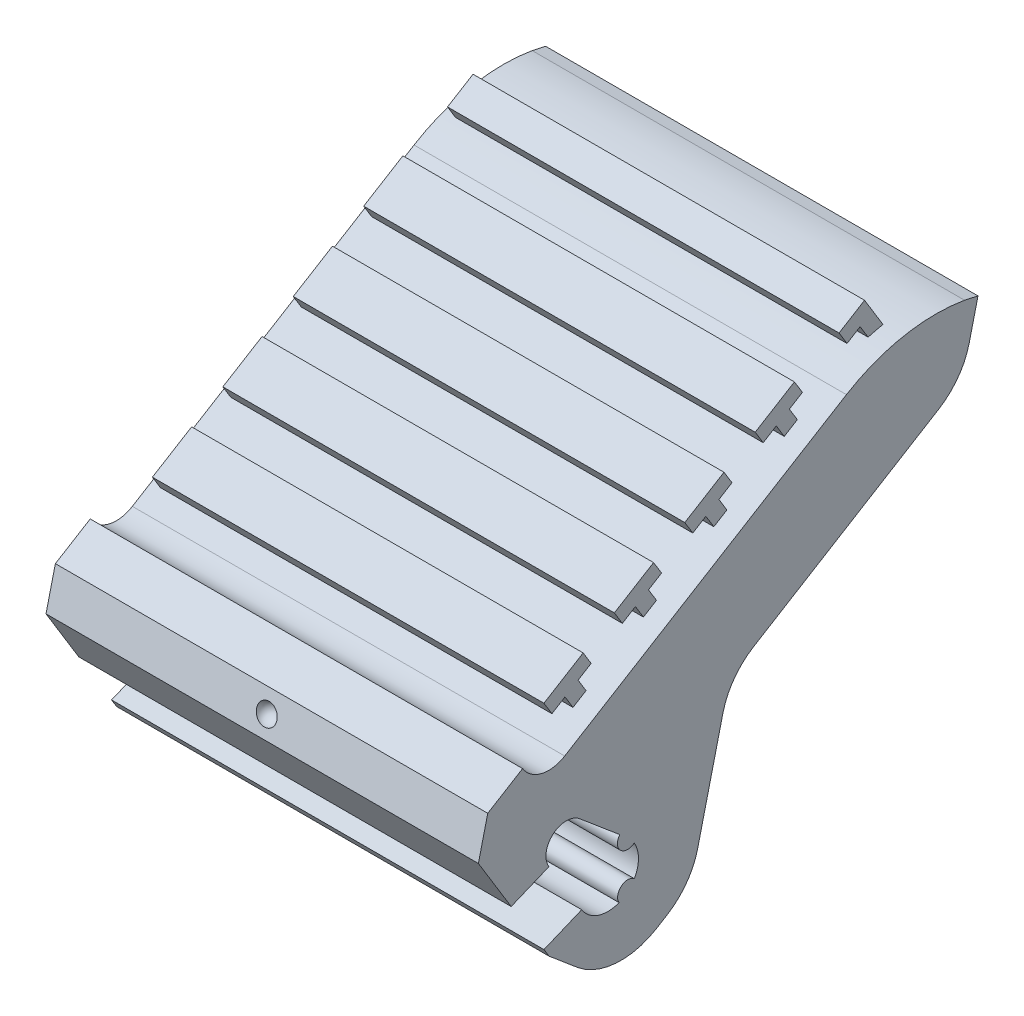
ISO-10303-21;
HEADER;
FILE_DESCRIPTION(('STEP AP214'),'2;1');
FILE_NAME('part.step','',(''),(''),'','','');
FILE_SCHEMA(('AUTOMOTIVE_DESIGN { 1 0 10303 214 1 1 1 1 }'));
ENDSEC;
DATA;
#1=APPLICATION_CONTEXT('core data for automotive mechanical design processes');
#2=APPLICATION_PROTOCOL_DEFINITION('international standard','automotive_design',2000,#1);
#3=PRODUCT_CONTEXT('',#1,'mechanical');
#4=PRODUCT('Part','Part','',(#3));
#5=PRODUCT_RELATED_PRODUCT_CATEGORY('part','',(#4));
#6=PRODUCT_DEFINITION_FORMATION('','',#4);
#7=PRODUCT_DEFINITION_CONTEXT('part definition',#1,'design');
#8=PRODUCT_DEFINITION('design','',#6,#7);
#9=PRODUCT_DEFINITION_SHAPE('','',#8);
#10=(LENGTH_UNIT() NAMED_UNIT(*) SI_UNIT(.MILLI.,.METRE.));
#11=(NAMED_UNIT(*) PLANE_ANGLE_UNIT() SI_UNIT($,.RADIAN.));
#12=(NAMED_UNIT(*) SI_UNIT($,.STERADIAN.) SOLID_ANGLE_UNIT());
#13=UNCERTAINTY_MEASURE_WITH_UNIT(LENGTH_MEASURE(1.E-05),#10,'distance_accuracy_value','');
#14=(GEOMETRIC_REPRESENTATION_CONTEXT(3) GLOBAL_UNCERTAINTY_ASSIGNED_CONTEXT((#13)) GLOBAL_UNIT_ASSIGNED_CONTEXT((#10,
#11,#12)) REPRESENTATION_CONTEXT('',''));
#15=CARTESIAN_POINT('',(0.,0.,0.));
#16=DIRECTION('',(0.,0.,1.));
#17=DIRECTION('',(1.,0.,0.));
#18=AXIS2_PLACEMENT_3D('',#15,#16,#17);
#19=CARTESIAN_POINT('',(-15.875,9.,11.375));
#20=DIRECTION('',(1.,0.,0.));
#21=DIRECTION('',(0.,1.,0.));
#22=AXIS2_PLACEMENT_3D('',#19,#20,#21);
#23=PLANE('',#22);
#24=CARTESIAN_POINT('',(-15.875,30.7323800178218,-113.210549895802));
#25=DIRECTION('',(1.,0.,0.));
#26=DIRECTION('',(0.,1.,0.));
#27=AXIS2_PLACEMENT_3D('',#24,#25,#26);
#28=CIRCLE('',#27,12.582258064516);
#29=CARTESIAN_POINT('',(-15.875,41.469471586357,-106.650970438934));
#30=VERTEX_POINT('',#29);
#31=CARTESIAN_POINT('',(-15.875,43.1357507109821,-115.324695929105));
#32=VERTEX_POINT('',#31);
#33=EDGE_CURVE('E696',#30,#32,#28,.F.);
#34=ORIENTED_EDGE('',*,*,#33,.T.);
#35=DIRECTION('',(0.,-0.214617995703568,-0.976698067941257));
#36=VECTOR('',#35,1.);
#37=CARTESIAN_POINT('',(-15.875,68.1218357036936,-1.61633304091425));
#38=LINE('',#37,#36);
#39=CARTESIAN_POINT('',(-15.875,42.9187557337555,-116.312211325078));
#40=VERTEX_POINT('',#39);
#41=EDGE_CURVE('E488',#32,#40,#38,.T.);
#42=ORIENTED_EDGE('',*,*,#41,.T.);
#43=DIRECTION('',(0.,-0.972050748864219,0.234770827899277));
#44=VECTOR('',#43,1.);
#45=CARTESIAN_POINT('',(-15.875,-18.2698794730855,-101.533860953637));
#46=LINE('',#45,#44);
#47=CARTESIAN_POINT('',(-15.875,40.2370195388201,-115.664515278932));
#48=VERTEX_POINT('',#47);
#49=EDGE_CURVE('E681',#40,#48,#46,.T.);
#50=ORIENTED_EDGE('',*,*,#49,.T.);
#51=CARTESIAN_POINT('',(-15.875,41.4108736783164,-110.804261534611));
#52=DIRECTION('',(1.,0.,0.));
#53=DIRECTION('',(0.,1.,0.));
#54=AXIS2_PLACEMENT_3D('',#51,#52,#53);
#55=CIRCLE('',#54,5.);
#56=CARTESIAN_POINT('',(-15.875,37.1441150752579,-113.410939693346));
#57=VERTEX_POINT('',#56);
#58=EDGE_CURVE('E1044',#48,#57,#55,.F.);
#59=ORIENTED_EDGE('',*,*,#58,.T.);
#60=DIRECTION('',(0.,-0.521335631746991,0.85335172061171));
#61=VECTOR('',#60,1.);
#62=CARTESIAN_POINT('',(-15.875,-26.0202982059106,-10.019846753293));
#63=LINE('',#62,#61);
#64=CARTESIAN_POINT('',(-15.875,28.8518229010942,-99.8376457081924));
#65=VERTEX_POINT('',#64);
#66=EDGE_CURVE('E675',#57,#65,#63,.T.);
#67=ORIENTED_EDGE('',*,*,#66,.T.);
#68=CARTESIAN_POINT('',(-15.875,24.5850642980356,-102.444323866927));
#69=DIRECTION('',(1.,0.,0.));
#70=DIRECTION('',(0.,1.,0.));
#71=AXIS2_PLACEMENT_3D('',#68,#69,#70);
#72=CIRCLE('',#71,5.);
#73=CARTESIAN_POINT('',(-15.875,25.758918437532,-97.5840701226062));
#74=VERTEX_POINT('',#73);
#75=EDGE_CURVE('E1070',#65,#74,#72,.T.);
#76=ORIENTED_EDGE('',*,*,#75,.T.);
#77=DIRECTION('',(0.,-0.972050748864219,0.234770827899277));
#78=VECTOR('',#77,1.);
#79=CARTESIAN_POINT('',(-15.875,-14.9417507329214,-87.7539971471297));
#80=LINE('',#79,#78);
#81=CARTESIAN_POINT('',(-15.875,18.0526898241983,-95.7228528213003));
#82=VERTEX_POINT('',#81);
#83=EDGE_CURVE('E678',#74,#82,#80,.T.);
#84=ORIENTED_EDGE('',*,*,#83,.T.);
#85=CARTESIAN_POINT('',(-15.875,19.2265439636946,-90.8625990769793));
#86=DIRECTION('',(1.,0.,0.));
#87=DIRECTION('',(0.,1.,0.));
#88=AXIS2_PLACEMENT_3D('',#85,#86,#87);
#89=CIRCLE('',#88,5.);
#90=CARTESIAN_POINT('',(-15.875,14.9597853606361,-93.4692772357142));
#91=VERTEX_POINT('',#90);
#92=EDGE_CURVE('E1047',#82,#91,#89,.F.);
#93=ORIENTED_EDGE('',*,*,#92,.T.);
#94=DIRECTION('',(0.,-0.521335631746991,0.85335172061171));
#95=VECTOR('',#94,1.);
#96=CARTESIAN_POINT('',(-15.875,28.0291819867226,-114.862006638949));
#97=LINE('',#96,#95);
#98=CARTESIAN_POINT('',(-15.875,14.4944285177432,-92.7075547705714));
#99=VERTEX_POINT('',#98);
#100=EDGE_CURVE('E573',#91,#99,#97,.T.);
#101=ORIENTED_EDGE('',*,*,#100,.T.);
#102=CARTESIAN_POINT('',(-15.875,18.7611871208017,-90.1008766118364));
#103=DIRECTION('',(1.,0.,0.));
#104=DIRECTION('',(0.,1.,0.));
#105=AXIS2_PLACEMENT_3D('',#102,#103,#104);
#106=CIRCLE('',#105,5.);
#107=CARTESIAN_POINT('',(-15.875,14.9377634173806,-86.8788537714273));
#108=VERTEX_POINT('',#107);
#109=EDGE_CURVE('E560',#99,#108,#106,.F.);
#110=ORIENTED_EDGE('',*,*,#109,.T.);
#111=DIRECTION('',(0.,0.644404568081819,0.764684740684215));
#112=VECTOR('',#111,1.);
#113=CARTESIAN_POINT('',(-15.875,60.8882560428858,-32.3515548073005));
#114=LINE('',#113,#112);
#115=CARTESIAN_POINT('',(-15.8750025,16.6812190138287,-84.8099766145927));
#116=VERTEX_POINT('',#115);
#117=EDGE_CURVE('E561',#108,#116,#114,.T.);
#118=ORIENTED_EDGE('',*,*,#117,.T.);
#119=DIRECTION('',(0.,-0.85335172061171,-0.521335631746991));
#120=VECTOR('',#119,1.);
#121=CARTESIAN_POINT('',(-15.875,53.8787130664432,-62.0850220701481));
#122=LINE('',#121,#120);
#123=CARTESIAN_POINT('',(-15.875,17.2858812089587,-84.4405721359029));
#124=VERTEX_POINT('',#123);
#125=EDGE_CURVE('E1001',#124,#116,#122,.T.);
#126=ORIENTED_EDGE('',*,*,#125,.F.);
#127=DIRECTION('',(0.,0.38268343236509,-0.923879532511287));
#128=VECTOR('',#127,1.);
#129=CARTESIAN_POINT('',(-15.875,-17.8034784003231,0.27263572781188));
#130=LINE('',#129,#128);
#131=CARTESIAN_POINT('',(-15.875,18.433931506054,-87.2122107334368));
#132=VERTEX_POINT('',#131);
#133=EDGE_CURVE('E631',#124,#132,#130,.T.);
#134=ORIENTED_EDGE('',*,*,#133,.T.);
#135=CARTESIAN_POINT('',(-15.875,19.6069366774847,-89.1322521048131));
#136=DIRECTION('',(1.,0.,0.));
#137=DIRECTION('',(0.,1.,0.));
#138=AXIS2_PLACEMENT_3D('',#135,#136,#137);
#139=CIRCLE('',#138,2.25000000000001);
#140=CARTESIAN_POINT('',(-15.875,17.5129547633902,-89.9555016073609));
#141=VERTEX_POINT('',#140);
#142=EDGE_CURVE('E625',#132,#141,#139,.T.);
#143=ORIENTED_EDGE('',*,*,#142,.T.);
#144=CARTESIAN_POINT('',(-15.875,17.8998654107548,-90.5979968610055));
#145=DIRECTION('',(1.,0.,0.));
#146=DIRECTION('',(0.,1.,0.));
#147=AXIS2_PLACEMENT_3D('',#144,#145,#146);
#148=CIRCLE('',#147,0.74999999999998);
#149=CARTESIAN_POINT('',(-15.875,18.4764506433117,-91.0776315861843));
#150=VERTEX_POINT('',#149);
#151=EDGE_CURVE('E657',#141,#150,#148,.F.);
#152=ORIENTED_EDGE('',*,*,#151,.T.);
#153=CARTESIAN_POINT('',(-15.875,20.7553481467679,-91.0671038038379));
#154=VERTEX_POINT('',#153);
#155=EDGE_CURVE('E630',#150,#154,#139,.T.);
#156=ORIENTED_EDGE('',*,*,#155,.T.);
#157=CARTESIAN_POINT('',(-15.875,21.3274773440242,-90.5821623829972));
#158=DIRECTION('',(1.,0.,0.));
#159=DIRECTION('',(0.,1.,0.));
#160=AXIS2_PLACEMENT_3D('',#157,#158,#159);
#161=CIRCLE('',#160,0.749999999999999);
#162=CARTESIAN_POINT('',(-15.875,21.8107807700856,-90.0086488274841));
#163=VERTEX_POINT('',#162);
#164=EDGE_CURVE('E665',#154,#163,#161,.F.);
#165=ORIENTED_EDGE('',*,*,#164,.T.);
#166=DIRECTION('',(0.,0.644404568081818,0.764684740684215));
#167=VECTOR('',#166,1.);
#168=CARTESIAN_POINT('',(-15.875,66.449460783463,-37.0380164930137));
#169=LINE('',#168,#167);
#170=CARTESIAN_POINT('',(-15.875,24.3020957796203,-87.0523219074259));
#171=VERTEX_POINT('',#170);
#172=EDGE_CURVE('E623',#163,#171,#169,.T.);
#173=ORIENTED_EDGE('',*,*,#172,.T.);
#174=CARTESIAN_POINT('',(-15.875,23.155068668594,-86.0857150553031));
#175=DIRECTION('',(1.,0.,0.));
#176=DIRECTION('',(0.,1.,0.));
#177=AXIS2_PLACEMENT_3D('',#174,#175,#176);
#178=CIRCLE('',#177,1.49999999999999);
#179=CARTESIAN_POINT('',(-15.875,22.3730652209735,-84.8056874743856));
#180=VERTEX_POINT('',#179);
#181=EDGE_CURVE('E619',#171,#180,#178,.T.);
#182=ORIENTED_EDGE('',*,*,#181,.T.);
#183=DIRECTION('',(0.,-0.382683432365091,0.923879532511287));
#184=VECTOR('',#183,1.);
#185=CARTESIAN_POINT('',(-15.875,-13.5903830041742,2.01775698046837));
#186=LINE('',#185,#184);
#187=CARTESIAN_POINT('',(-15.875,21.2250149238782,-82.0340488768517));
#188=VERTEX_POINT('',#187);
#189=EDGE_CURVE('E633',#180,#188,#186,.T.);
#190=ORIENTED_EDGE('',*,*,#189,.T.);
#191=DIRECTION('',(0.,0.853351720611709,0.521335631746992));
#192=VECTOR('',#191,1.);
#193=CARTESIAN_POINT('',(-15.875,21.8296771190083,-81.6646443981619));
#194=LINE('',#193,#192);
#195=CARTESIAN_POINT('',(-15.875,25.1681608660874,-79.625074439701));
#196=VERTEX_POINT('',#195);
#197=EDGE_CURVE('E55',#188,#196,#194,.T.);
#198=ORIENTED_EDGE('',*,*,#197,.T.);
#199=DIRECTION('',(0.,0.972050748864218,-0.234770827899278));
#200=VECTOR('',#199,1.);
#201=CARTESIAN_POINT('',(-15.875,-10.8759044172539,-70.91966985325));
#202=LINE('',#201,#200);
#203=CARTESIAN_POINT('',(-15.875,28.0153981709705,-80.3127425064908));
#204=VERTEX_POINT('',#203);
#205=EDGE_CURVE('E605',#196,#204,#202,.T.);
#206=ORIENTED_EDGE('',*,*,#205,.T.);
#207=DIRECTION('',(0.,0.521335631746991,-0.85335172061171));
#208=VECTOR('',#207,1.);
#209=CARTESIAN_POINT('',(-15.875,26.9356135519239,-78.5452898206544));
#210=LINE('',#209,#208);
#211=CARTESIAN_POINT('',(-15.875,29.5794050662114,-82.872797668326));
#212=VERTEX_POINT('',#211);
#213=EDGE_CURVE('E580',#204,#212,#210,.T.);
#214=ORIENTED_EDGE('',*,*,#213,.T.);
#215=CARTESIAN_POINT('',(-15.875,30.7524102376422,-84.7928390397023));
#216=DIRECTION('',(1.,0.,0.));
#217=DIRECTION('',(0.,1.,0.));
#218=AXIS2_PLACEMENT_3D('',#215,#216,#217);
#219=CIRCLE('',#218,2.25000000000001);
#220=CARTESIAN_POINT('',(-15.875,28.8323688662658,-85.9658442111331));
#221=VERTEX_POINT('',#220);
#222=EDGE_CURVE('E694',#212,#221,#219,.T.);
#223=ORIENTED_EDGE('',*,*,#222,.T.);
#224=DIRECTION('',(0.,0.521335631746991,-0.85335172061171));
#225=VECTOR('',#224,1.);
#226=CARTESIAN_POINT('',(-15.875,-19.8631408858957,-6.25827292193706));
#227=LINE('',#226,#225);
#228=EDGE_CURVE('E691',#221,#30,#227,.T.);
#229=ORIENTED_EDGE('',*,*,#228,.T.);
#230=EDGE_LOOP('',(#34,#42,#50,#59,#67,#76,#84,#93,#101,#110,#118,#126,#134,#143,#152,#156,#165,
#173,#182,#190,#198,#206,#214,#223,#229));
#231=FACE_BOUND('',#230,.T.);
#232=ADVANCED_FACE('F32',(#231),#23,.F.);
#233=CARTESIAN_POINT('',(15.875,9.,11.375));
#234=DIRECTION('',(-1.,0.,0.));
#235=DIRECTION('',(0.,-1.,0.));
#236=AXIS2_PLACEMENT_3D('',#233,#234,#235);
#237=PLANE('',#236);
#238=DIRECTION('',(0.,-0.972050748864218,0.234770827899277));
#239=VECTOR('',#238,1.);
#240=CARTESIAN_POINT('',(15.875,38.2238365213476,-115.178288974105));
#241=LINE('',#240,#239);
#242=CARTESIAN_POINT('',(15.875,42.9187557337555,-116.312211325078));
#243=VERTEX_POINT('',#242);
#244=CARTESIAN_POINT('',(15.875,40.23701953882,-115.664515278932));
#245=VERTEX_POINT('',#244);
#246=EDGE_CURVE('E502',#243,#245,#241,.T.);
#247=ORIENTED_EDGE('',*,*,#246,.F.);
#248=DIRECTION('',(0.,-0.214617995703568,-0.976698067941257));
#249=VECTOR('',#248,1.);
#250=CARTESIAN_POINT('',(15.875,65.3228945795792,-14.3539433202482));
#251=LINE('',#250,#249);
#252=CARTESIAN_POINT('',(15.875,43.1357507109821,-115.324695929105));
#253=VERTEX_POINT('',#252);
#254=EDGE_CURVE('E485',#253,#243,#251,.T.);
#255=ORIENTED_EDGE('',*,*,#254,.F.);
#256=CARTESIAN_POINT('',(15.875,30.7323800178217,-113.210549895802));
#257=DIRECTION('',(-1.,0.,0.));
#258=DIRECTION('',(0.,-1.,0.));
#259=AXIS2_PLACEMENT_3D('',#256,#257,#258);
#260=CIRCLE('',#259,12.582258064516);
#261=CARTESIAN_POINT('',(15.875,41.469471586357,-106.650970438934));
#262=VERTEX_POINT('',#261);
#263=EDGE_CURVE('E500',#253,#262,#260,.F.);
#264=ORIENTED_EDGE('',*,*,#263,.T.);
#265=DIRECTION('',(0.,-0.521335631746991,0.85335172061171));
#266=VECTOR('',#265,1.);
#267=CARTESIAN_POINT('',(15.875,-19.8631408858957,-6.25827292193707));
#268=LINE('',#267,#266);
#269=CARTESIAN_POINT('',(15.875,28.8323688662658,-85.9658442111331));
#270=VERTEX_POINT('',#269);
#271=EDGE_CURVE('E513',#262,#270,#268,.T.);
#272=ORIENTED_EDGE('',*,*,#271,.T.);
#273=CARTESIAN_POINT('',(15.875,30.7524102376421,-84.7928390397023));
#274=DIRECTION('',(-1.,0.,0.));
#275=DIRECTION('',(0.,-1.,0.));
#276=AXIS2_PLACEMENT_3D('',#273,#274,#275);
#277=CIRCLE('',#276,2.25000000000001);
#278=CARTESIAN_POINT('',(15.875,29.5794050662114,-82.872797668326));
#279=VERTEX_POINT('',#278);
#280=EDGE_CURVE('E509',#270,#279,#277,.T.);
#281=ORIENTED_EDGE('',*,*,#280,.T.);
#282=DIRECTION('',(0.,-0.521335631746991,0.85335172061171));
#283=VECTOR('',#282,1.);
#284=CARTESIAN_POINT('',(15.875,26.9356135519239,-78.5452898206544));
#285=LINE('',#284,#283);
#286=CARTESIAN_POINT('',(15.875,28.0153981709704,-80.3127425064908));
#287=VERTEX_POINT('',#286);
#288=EDGE_CURVE('E47',#279,#287,#285,.T.);
#289=ORIENTED_EDGE('',*,*,#288,.T.);
#290=DIRECTION('',(0.,0.972050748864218,-0.234770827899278));
#291=VECTOR('',#290,1.);
#292=CARTESIAN_POINT('',(15.875,25.1681608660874,-79.625074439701));
#293=LINE('',#292,#291);
#294=CARTESIAN_POINT('',(15.875,25.1681608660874,-79.625074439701));
#295=VERTEX_POINT('',#294);
#296=EDGE_CURVE('E606',#295,#287,#293,.T.);
#297=ORIENTED_EDGE('',*,*,#296,.F.);
#298=DIRECTION('',(0.,-0.853351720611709,-0.521335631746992));
#299=VECTOR('',#298,1.);
#300=CARTESIAN_POINT('',(15.875,21.8296771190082,-81.6646443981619));
#301=LINE('',#300,#299);
#302=CARTESIAN_POINT('',(15.875,21.2250149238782,-82.0340488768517));
#303=VERTEX_POINT('',#302);
#304=EDGE_CURVE('E574',#295,#303,#301,.T.);
#305=ORIENTED_EDGE('',*,*,#304,.T.);
#306=DIRECTION('',(0.,-0.382683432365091,0.923879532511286));
#307=VECTOR('',#306,1.);
#308=CARTESIAN_POINT('',(15.875,16.8846693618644,-71.5555277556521));
#309=LINE('',#308,#307);
#310=CARTESIAN_POINT('',(15.875,22.3730652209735,-84.8056874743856));
#311=VERTEX_POINT('',#310);
#312=EDGE_CURVE('E652',#311,#303,#309,.T.);
#313=ORIENTED_EDGE('',*,*,#312,.F.);
#314=CARTESIAN_POINT('',(15.875,23.155068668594,-86.0857150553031));
#315=DIRECTION('',(1.,0.,0.));
#316=DIRECTION('',(0.,-1.,0.));
#317=AXIS2_PLACEMENT_3D('',#314,#315,#316);
#318=CIRCLE('',#317,1.49999999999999);
#319=CARTESIAN_POINT('',(15.875,24.3020957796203,-87.0523219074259));
#320=VERTEX_POINT('',#319);
#321=EDGE_CURVE('E655',#320,#311,#318,.T.);
#322=ORIENTED_EDGE('',*,*,#321,.F.);
#323=DIRECTION('',(0.,0.644404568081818,0.764684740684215));
#324=VECTOR('',#323,1.);
#325=CARTESIAN_POINT('',(15.875,24.3020957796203,-87.0523219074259));
#326=LINE('',#325,#324);
#327=CARTESIAN_POINT('',(15.875,21.8107807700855,-90.0086488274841));
#328=VERTEX_POINT('',#327);
#329=EDGE_CURVE('E640',#328,#320,#326,.T.);
#330=ORIENTED_EDGE('',*,*,#329,.F.);
#331=CARTESIAN_POINT('',(15.875,21.3274773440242,-90.5821623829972));
#332=DIRECTION('',(1.,0.,0.));
#333=DIRECTION('',(0.,1.,0.));
#334=AXIS2_PLACEMENT_3D('',#331,#332,#333);
#335=CIRCLE('',#334,0.749999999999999);
#336=CARTESIAN_POINT('',(15.875,20.7553481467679,-91.0671038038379));
#337=VERTEX_POINT('',#336);
#338=EDGE_CURVE('E610',#328,#337,#335,.T.);
#339=ORIENTED_EDGE('',*,*,#338,.T.);
#340=CARTESIAN_POINT('',(15.875,19.6069366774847,-89.1322521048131));
#341=DIRECTION('',(1.,0.,0.));
#342=DIRECTION('',(0.,1.,0.));
#343=AXIS2_PLACEMENT_3D('',#340,#341,#342);
#344=CIRCLE('',#343,2.25000000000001);
#345=CARTESIAN_POINT('',(15.875,18.4764506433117,-91.0776315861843));
#346=VERTEX_POINT('',#345);
#347=EDGE_CURVE('E649',#346,#337,#344,.T.);
#348=ORIENTED_EDGE('',*,*,#347,.F.);
#349=CARTESIAN_POINT('',(15.875,17.8998654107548,-90.5979968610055));
#350=DIRECTION('',(1.,0.,0.));
#351=DIRECTION('',(0.,1.,0.));
#352=AXIS2_PLACEMENT_3D('',#349,#350,#351);
#353=CIRCLE('',#352,0.74999999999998);
#354=CARTESIAN_POINT('',(15.875,17.5129547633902,-89.9555016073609));
#355=VERTEX_POINT('',#354);
#356=EDGE_CURVE('E659',#346,#355,#353,.T.);
#357=ORIENTED_EDGE('',*,*,#356,.T.);
#358=CARTESIAN_POINT('',(15.875,18.433931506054,-87.2122107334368));
#359=VERTEX_POINT('',#358);
#360=EDGE_CURVE('E646',#359,#355,#344,.T.);
#361=ORIENTED_EDGE('',*,*,#360,.F.);
#362=DIRECTION('',(0.,0.38268343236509,-0.923879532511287));
#363=VECTOR('',#362,1.);
#364=CARTESIAN_POINT('',(15.875,17.2858812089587,-84.4405721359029));
#365=LINE('',#364,#363);
#366=CARTESIAN_POINT('',(15.875,17.2858812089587,-84.4405721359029));
#367=VERTEX_POINT('',#366);
#368=EDGE_CURVE('E650',#367,#359,#365,.T.);
#369=ORIENTED_EDGE('',*,*,#368,.F.);
#370=DIRECTION('',(0.,-0.85335172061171,-0.521335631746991));
#371=VECTOR('',#370,1.);
#372=CARTESIAN_POINT('',(15.875,42.2642903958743,-69.1805868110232));
#373=LINE('',#372,#371);
#374=CARTESIAN_POINT('',(15.875,16.6812190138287,-84.8099766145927));
#375=VERTEX_POINT('',#374);
#376=EDGE_CURVE('E1024',#367,#375,#373,.T.);
#377=ORIENTED_EDGE('',*,*,#376,.T.);
#378=DIRECTION('',(0.,0.644404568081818,0.764684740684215));
#379=VECTOR('',#378,1.);
#380=CARTESIAN_POINT('',(15.875,16.6812190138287,-84.8099766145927));
#381=LINE('',#380,#379);
#382=CARTESIAN_POINT('',(15.875,14.9377634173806,-86.8788537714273));
#383=VERTEX_POINT('',#382);
#384=EDGE_CURVE('E566',#383,#375,#381,.T.);
#385=ORIENTED_EDGE('',*,*,#384,.F.);
#386=CARTESIAN_POINT('',(15.875,18.7611871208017,-90.1008766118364));
#387=DIRECTION('',(-1.,0.,0.));
#388=DIRECTION('',(0.,-1.,0.));
#389=AXIS2_PLACEMENT_3D('',#386,#387,#388);
#390=CIRCLE('',#389,5.);
#391=CARTESIAN_POINT('',(15.875,14.4944285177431,-92.7075547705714));
#392=VERTEX_POINT('',#391);
#393=EDGE_CURVE('E552',#383,#392,#390,.F.);
#394=ORIENTED_EDGE('',*,*,#393,.T.);
#395=DIRECTION('',(0.,0.521335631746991,-0.85335172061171));
#396=VECTOR('',#395,1.);
#397=CARTESIAN_POINT('',(15.875,28.0291819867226,-114.862006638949));
#398=LINE('',#397,#396);
#399=CARTESIAN_POINT('',(15.875,14.9597853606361,-93.4692772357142));
#400=VERTEX_POINT('',#399);
#401=EDGE_CURVE('E586',#392,#400,#398,.T.);
#402=ORIENTED_EDGE('',*,*,#401,.T.);
#403=CARTESIAN_POINT('',(15.875,19.2265439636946,-90.8625990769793));
#404=DIRECTION('',(-1.,0.,0.));
#405=DIRECTION('',(0.,-1.,0.));
#406=AXIS2_PLACEMENT_3D('',#403,#404,#405);
#407=CIRCLE('',#406,5.);
#408=CARTESIAN_POINT('',(15.875,18.0526898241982,-95.7228528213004));
#409=VERTEX_POINT('',#408);
#410=EDGE_CURVE('E554',#400,#409,#407,.F.);
#411=ORIENTED_EDGE('',*,*,#410,.T.);
#412=DIRECTION('',(0.,-0.972050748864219,0.234770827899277));
#413=VECTOR('',#412,1.);
#414=CARTESIAN_POINT('',(15.875,16.0395068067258,-95.2366265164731));
#415=LINE('',#414,#413);
#416=CARTESIAN_POINT('',(15.875,25.758918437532,-97.5840701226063));
#417=VERTEX_POINT('',#416);
#418=EDGE_CURVE('E684',#417,#409,#415,.T.);
#419=ORIENTED_EDGE('',*,*,#418,.F.);
#420=CARTESIAN_POINT('',(15.875,24.5850642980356,-102.444323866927));
#421=DIRECTION('',(-1.,0.,0.));
#422=DIRECTION('',(0.,-1.,0.));
#423=AXIS2_PLACEMENT_3D('',#420,#421,#422);
#424=CIRCLE('',#423,5.);
#425=CARTESIAN_POINT('',(15.875,28.8518229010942,-99.8376457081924));
#426=VERTEX_POINT('',#425);
#427=EDGE_CURVE('E40',#417,#426,#424,.T.);
#428=ORIENTED_EDGE('',*,*,#427,.T.);
#429=DIRECTION('',(0.,-0.521335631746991,0.85335172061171));
#430=VECTOR('',#429,1.);
#431=CARTESIAN_POINT('',(15.875,27.7721014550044,-98.0702964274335));
#432=LINE('',#431,#430);
#433=CARTESIAN_POINT('',(15.875,37.1441150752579,-113.410939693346));
#434=VERTEX_POINT('',#433);
#435=EDGE_CURVE('E687',#434,#426,#432,.T.);
#436=ORIENTED_EDGE('',*,*,#435,.F.);
#437=CARTESIAN_POINT('',(15.875,41.4108736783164,-110.804261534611));
#438=DIRECTION('',(-1.,0.,0.));
#439=DIRECTION('',(0.,-1.,0.));
#440=AXIS2_PLACEMENT_3D('',#437,#438,#439);
#441=CIRCLE('',#440,5.);
#442=EDGE_CURVE('E556',#434,#245,#441,.F.);
#443=ORIENTED_EDGE('',*,*,#442,.T.);
#444=EDGE_LOOP('',(#247,#255,#264,#272,#281,#289,#297,#305,#313,#322,#330,#339,#348,#357,#361,
#369,#377,#385,#394,#402,#411,#419,#428,#436,#443));
#445=FACE_BOUND('',#444,.T.);
#446=ADVANCED_FACE('F498',(#445),#237,.F.);
#447=CARTESIAN_POINT('',(-15.87505,17.2858812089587,-84.4405721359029));
#448=DIRECTION('',(0.,-0.923879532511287,-0.38268343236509));
#449=DIRECTION('',(0.,0.38268343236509,-0.923879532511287));
#450=AXIS2_PLACEMENT_3D('',#447,#448,#449);
#451=PLANE('',#450);
#452=DIRECTION('',(-1.,0.,0.));
#453=VECTOR('',#452,1.);
#454=CARTESIAN_POINT('',(-15.87505,17.2858812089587,-84.4405721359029));
#455=LINE('',#454,#453);
#456=EDGE_CURVE('E1019',#367,#124,#455,.T.);
#457=ORIENTED_EDGE('',*,*,#456,.F.);
#458=ORIENTED_EDGE('',*,*,#368,.T.);
#459=DIRECTION('',(1.,0.,0.));
#460=VECTOR('',#459,1.);
#461=CARTESIAN_POINT('',(-15.87505,18.433931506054,-87.2122107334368));
#462=LINE('',#461,#460);
#463=EDGE_CURVE('E639',#132,#359,#462,.T.);
#464=ORIENTED_EDGE('',*,*,#463,.F.);
#465=ORIENTED_EDGE('',*,*,#133,.F.);
#466=EDGE_LOOP('',(#457,#458,#464,#465));
#467=FACE_BOUND('',#466,.T.);
#468=ADVANCED_FACE('F1143',(#467),#451,.F.);
#469=CARTESIAN_POINT('',(-15.87505,16.8846693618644,-71.5555277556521));
#470=DIRECTION('',(0.,0.923879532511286,0.382683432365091));
#471=DIRECTION('',(0.,-0.382683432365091,0.923879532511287));
#472=AXIS2_PLACEMENT_3D('',#469,#470,#471);
#473=PLANE('',#472);
#474=DIRECTION('',(1.,0.,0.));
#475=VECTOR('',#474,1.);
#476=CARTESIAN_POINT('',(-15.87505,21.2250149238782,-82.0340488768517));
#477=LINE('',#476,#475);
#478=EDGE_CURVE('E1022',#188,#303,#477,.T.);
#479=ORIENTED_EDGE('',*,*,#478,.F.);
#480=ORIENTED_EDGE('',*,*,#189,.F.);
#481=DIRECTION('',(1.,0.,0.));
#482=VECTOR('',#481,1.);
#483=CARTESIAN_POINT('',(-15.87505,22.3730652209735,-84.8056874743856));
#484=LINE('',#483,#482);
#485=EDGE_CURVE('E636',#180,#311,#484,.T.);
#486=ORIENTED_EDGE('',*,*,#485,.T.);
#487=ORIENTED_EDGE('',*,*,#312,.T.);
#488=EDGE_LOOP('',(#479,#480,#486,#487));
#489=FACE_BOUND('',#488,.T.);
#490=ADVANCED_FACE('F1184',(#489),#473,.F.);
#491=CARTESIAN_POINT('',(-15.87505,27.7721014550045,-98.0702964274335));
#492=DIRECTION('',(0.,0.85335172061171,0.521335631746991));
#493=DIRECTION('',(0.,-0.521335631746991,0.85335172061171));
#494=AXIS2_PLACEMENT_3D('',#491,#492,#493);
#495=PLANE('',#494);
#496=ORIENTED_EDGE('',*,*,#66,.F.);
#497=DIRECTION('',(1.,0.,0.));
#498=VECTOR('',#497,1.);
#499=CARTESIAN_POINT('',(-15.87505,37.1441150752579,-113.410939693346));
#500=LINE('',#499,#498);
#501=CARTESIAN_POINT('',(-12.875,37.1441150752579,-113.410939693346));
#502=VERTEX_POINT('',#501);
#503=EDGE_CURVE('E537',#57,#502,#500,.T.);
#504=ORIENTED_EDGE('',*,*,#503,.T.);
#505=DIRECTION('',(0.,0.521335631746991,-0.85335172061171));
#506=VECTOR('',#505,1.);
#507=CARTESIAN_POINT('',(-12.875,27.7721014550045,-98.0702964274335));
#508=LINE('',#507,#506);
#509=CARTESIAN_POINT('',(-12.875,28.8518229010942,-99.8376457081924));
#510=VERTEX_POINT('',#509);
#511=EDGE_CURVE('E698',#510,#502,#508,.T.);
#512=ORIENTED_EDGE('',*,*,#511,.F.);
#513=DIRECTION('',(1.,0.,0.));
#514=VECTOR('',#513,1.);
#515=CARTESIAN_POINT('',(-15.875,28.8518229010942,-99.8376457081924));
#516=LINE('',#515,#514);
#517=EDGE_CURVE('E533',#510,#65,#516,.F.);
#518=ORIENTED_EDGE('',*,*,#517,.T.);
#519=EDGE_LOOP('',(#496,#504,#512,#518));
#520=FACE_BOUND('',#519,.T.);
#521=ADVANCED_FACE('F1115',(#520),#495,.F.);
#522=CARTESIAN_POINT('',(-15.8752650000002,-17.2487182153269,-10.5377081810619));
#523=DIRECTION('',(0.,-0.85335172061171,-0.521335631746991));
#524=DIRECTION('',(0.,0.521335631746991,-0.85335172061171));
#525=AXIS2_PLACEMENT_3D('',#522,#523,#524);
#526=PLANE('',#525);
#527=DIRECTION('',(0.,0.521335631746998,-0.853351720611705));
#528=VECTOR('',#527,1.);
#529=CARTESIAN_POINT('',(14.375,30.7052579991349,-89.0314953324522));
#530=LINE('',#529,#528);
#531=CARTESIAN_POINT('',(14.375,30.1187554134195,-88.0714746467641));
#532=VERTEX_POINT('',#531);
#533=CARTESIAN_POINT('',(14.375,30.7052579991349,-89.0314953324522));
#534=VERTEX_POINT('',#533);
#535=EDGE_CURVE('E789',#532,#534,#530,.T.);
#536=ORIENTED_EDGE('',*,*,#535,.F.);
#537=DIRECTION('',(-1.,0.,0.));
#538=VECTOR('',#537,1.);
#539=CARTESIAN_POINT('',(14.375,30.1187554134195,-88.0714746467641));
#540=LINE('',#539,#538);
#541=CARTESIAN_POINT('',(-14.375,30.1187554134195,-88.0714746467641));
#542=VERTEX_POINT('',#541);
#543=EDGE_CURVE('E743',#532,#542,#540,.T.);
#544=ORIENTED_EDGE('',*,*,#543,.T.);
#545=DIRECTION('',(0.,0.521335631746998,-0.853351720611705));
#546=VECTOR('',#545,1.);
#547=CARTESIAN_POINT('',(-14.375,30.7052579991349,-89.0314953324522));
#548=LINE('',#547,#546);
#549=CARTESIAN_POINT('',(-14.375,30.7052579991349,-89.0314953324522));
#550=VERTEX_POINT('',#549);
#551=EDGE_CURVE('E771',#542,#550,#548,.T.);
#552=ORIENTED_EDGE('',*,*,#551,.T.);
#553=DIRECTION('',(-1.,0.,0.));
#554=VECTOR('',#553,1.);
#555=CARTESIAN_POINT('',(14.375,30.7052579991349,-89.0314953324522));
#556=LINE('',#555,#554);
#557=EDGE_CURVE('E746',#534,#550,#556,.T.);
#558=ORIENTED_EDGE('',*,*,#557,.F.);
#559=EDGE_LOOP('',(#536,#544,#552,#558));
#560=FACE_BOUND('',#559,.T.);
#561=DIRECTION('',(1.,0.,0.));
#562=VECTOR('',#561,1.);
#563=CARTESIAN_POINT('',(-15.8752650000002,28.8323688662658,-85.9658442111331));
#564=LINE('',#563,#562);
#565=EDGE_CURVE('E492',#221,#270,#564,.T.);
#566=ORIENTED_EDGE('',*,*,#565,.T.);
#567=ORIENTED_EDGE('',*,*,#271,.F.);
#568=DIRECTION('',(1.,0.,0.));
#569=VECTOR('',#568,1.);
#570=CARTESIAN_POINT('',(-15.8752650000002,41.469471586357,-106.650970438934));
#571=LINE('',#570,#569);
#572=EDGE_CURVE('E493',#30,#262,#571,.T.);
#573=ORIENTED_EDGE('',*,*,#572,.F.);
#574=ORIENTED_EDGE('',*,*,#228,.F.);
#575=EDGE_LOOP('',(#566,#567,#573,#574));
#576=FACE_BOUND('',#575,.T.);
#577=DIRECTION('',(-1.,0.,0.));
#578=VECTOR('',#577,1.);
#579=CARTESIAN_POINT('',(14.375,33.8645336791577,-94.2027768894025));
#580=LINE('',#579,#578);
#581=CARTESIAN_POINT('',(14.375,33.8645336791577,-94.2027768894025));
#582=VERTEX_POINT('',#581);
#583=CARTESIAN_POINT('',(-14.375,33.8645336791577,-94.2027768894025));
#584=VERTEX_POINT('',#583);
#585=EDGE_CURVE('E845',#582,#584,#580,.T.);
#586=ORIENTED_EDGE('',*,*,#585,.F.);
#587=DIRECTION('',(0.,0.521335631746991,-0.85335172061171));
#588=VECTOR('',#587,1.);
#589=CARTESIAN_POINT('',(14.375,33.2780310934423,-93.2427562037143));
#590=LINE('',#589,#588);
#591=CARTESIAN_POINT('',(14.375,33.2780310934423,-93.2427562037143));
#592=VERTEX_POINT('',#591);
#593=EDGE_CURVE('E888',#592,#582,#590,.T.);
#594=ORIENTED_EDGE('',*,*,#593,.F.);
#595=DIRECTION('',(-1.,0.,0.));
#596=VECTOR('',#595,1.);
#597=CARTESIAN_POINT('',(14.375,33.2780310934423,-93.2427562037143));
#598=LINE('',#597,#596);
#599=CARTESIAN_POINT('',(-14.375,33.2780310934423,-93.2427562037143));
#600=VERTEX_POINT('',#599);
#601=EDGE_CURVE('E843',#592,#600,#598,.T.);
#602=ORIENTED_EDGE('',*,*,#601,.T.);
#603=DIRECTION('',(0.,0.521335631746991,-0.85335172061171));
#604=VECTOR('',#603,1.);
#605=CARTESIAN_POINT('',(-14.375,33.2780310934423,-93.2427562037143));
#606=LINE('',#605,#604);
#607=EDGE_CURVE('E870',#600,#584,#606,.T.);
#608=ORIENTED_EDGE('',*,*,#607,.T.);
#609=EDGE_LOOP('',(#586,#594,#602,#608));
#610=FACE_BOUND('',#609,.T.);
#611=DIRECTION('',(-1.,0.,0.));
#612=VECTOR('',#611,1.);
#613=CARTESIAN_POINT('',(14.375,40.1830850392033,-104.545340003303));
#614=LINE('',#613,#612);
#615=CARTESIAN_POINT('',(14.375,40.1830850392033,-104.545340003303));
#616=VERTEX_POINT('',#615);
#617=CARTESIAN_POINT('',(-14.375,40.1830850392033,-104.545340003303));
#618=VERTEX_POINT('',#617);
#619=EDGE_CURVE('E908',#616,#618,#614,.T.);
#620=ORIENTED_EDGE('',*,*,#619,.F.);
#621=DIRECTION('',(0.,0.521335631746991,-0.85335172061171));
#622=VECTOR('',#621,1.);
#623=CARTESIAN_POINT('',(14.375,39.5965824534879,-103.585319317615));
#624=LINE('',#623,#622);
#625=CARTESIAN_POINT('',(14.375,39.596582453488,-103.585319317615));
#626=VERTEX_POINT('',#625);
#627=EDGE_CURVE('E946',#626,#616,#624,.T.);
#628=ORIENTED_EDGE('',*,*,#627,.F.);
#629=DIRECTION('',(-1.,0.,0.));
#630=VECTOR('',#629,1.);
#631=CARTESIAN_POINT('',(14.375,39.5965824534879,-103.585319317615));
#632=LINE('',#631,#630);
#633=CARTESIAN_POINT('',(-14.375,39.5965824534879,-103.585319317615));
#634=VERTEX_POINT('',#633);
#635=EDGE_CURVE('E906',#626,#634,#632,.T.);
#636=ORIENTED_EDGE('',*,*,#635,.T.);
#637=DIRECTION('',(0.,0.521335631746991,-0.85335172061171));
#638=VECTOR('',#637,1.);
#639=CARTESIAN_POINT('',(-14.375,39.5965824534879,-103.585319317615));
#640=LINE('',#639,#638);
#641=EDGE_CURVE('E928',#634,#618,#640,.T.);
#642=ORIENTED_EDGE('',*,*,#641,.T.);
#643=EDGE_LOOP('',(#620,#628,#636,#642));
#644=FACE_BOUND('',#643,.T.);
#645=DIRECTION('',(0.,0.521335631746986,-0.853351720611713));
#646=VECTOR('',#645,1.);
#647=CARTESIAN_POINT('',(14.375,37.0238093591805,-99.3740584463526));
#648=LINE('',#647,#646);
#649=CARTESIAN_POINT('',(14.375,36.4373067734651,-98.4140377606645));
#650=VERTEX_POINT('',#649);
#651=CARTESIAN_POINT('',(14.375,37.0238093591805,-99.3740584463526));
#652=VERTEX_POINT('',#651);
#653=EDGE_CURVE('E1011',#650,#652,#648,.T.);
#654=ORIENTED_EDGE('',*,*,#653,.F.);
#655=DIRECTION('',(-1.,0.,0.));
#656=VECTOR('',#655,1.);
#657=CARTESIAN_POINT('',(14.375,36.4373067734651,-98.4140377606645));
#658=LINE('',#657,#656);
#659=CARTESIAN_POINT('',(-14.375,36.4373067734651,-98.4140377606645));
#660=VERTEX_POINT('',#659);
#661=EDGE_CURVE('E960',#650,#660,#658,.T.);
#662=ORIENTED_EDGE('',*,*,#661,.T.);
#663=DIRECTION('',(0.,0.521335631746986,-0.853351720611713));
#664=VECTOR('',#663,1.);
#665=CARTESIAN_POINT('',(-14.375,37.0238093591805,-99.3740584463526));
#666=LINE('',#665,#664);
#667=CARTESIAN_POINT('',(-14.375,37.0238093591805,-99.3740584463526));
#668=VERTEX_POINT('',#667);
#669=EDGE_CURVE('E993',#660,#668,#666,.T.);
#670=ORIENTED_EDGE('',*,*,#669,.T.);
#671=DIRECTION('',(-1.,0.,0.));
#672=VECTOR('',#671,1.);
#673=CARTESIAN_POINT('',(14.375,37.0238093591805,-99.3740584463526));
#674=LINE('',#673,#672);
#675=EDGE_CURVE('E963',#652,#668,#674,.T.);
#676=ORIENTED_EDGE('',*,*,#675,.F.);
#677=EDGE_LOOP('',(#654,#662,#670,#676));
#678=FACE_BOUND('',#677,.T.);
#679=ADVANCED_FACE('F1031',(#560,#576,#610,#644,#678),#526,.F.);
#680=CARTESIAN_POINT('',(-15.8752650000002,30.7323800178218,-113.210549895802));
#681=DIRECTION('',(1.,0.,0.));
#682=DIRECTION('',(0.,1.,0.));
#683=AXIS2_PLACEMENT_3D('',#680,#681,#682);
#684=CYLINDRICAL_SURFACE('',#683,12.582258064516);
#685=ORIENTED_EDGE('',*,*,#572,.T.);
#686=ORIENTED_EDGE('',*,*,#263,.F.);
#687=DIRECTION('',(1.,0.,0.));
#688=VECTOR('',#687,1.);
#689=CARTESIAN_POINT('',(-15.8752650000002,43.1357507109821,-115.324695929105));
#690=LINE('',#689,#688);
#691=EDGE_CURVE('E482',#32,#253,#690,.T.);
#692=ORIENTED_EDGE('',*,*,#691,.F.);
#693=ORIENTED_EDGE('',*,*,#33,.F.);
#694=EDGE_LOOP('',(#685,#686,#692,#693));
#695=FACE_BOUND('',#694,.T.);
#696=CARTESIAN_POINT('',(14.375,30.7323800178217,-113.210549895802));
#697=DIRECTION('',(-1.,0.,0.));
#698=DIRECTION('',(0.,0.,1.));
#699=AXIS2_PLACEMENT_3D('',#696,#697,#698);
#700=CIRCLE('',#699,12.582258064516);
#701=CARTESIAN_POINT('',(14.375,42.8272816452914,-109.742614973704));
#702=VERTEX_POINT('',#701);
#703=CARTESIAN_POINT('',(14.375,43.0886993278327,-110.836820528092));
#704=VERTEX_POINT('',#703);
#705=EDGE_CURVE('E529',#702,#704,#700,.T.);
#706=ORIENTED_EDGE('',*,*,#705,.F.);
#707=DIRECTION('',(-1.,0.,0.));
#708=VECTOR('',#707,1.);
#709=CARTESIAN_POINT('',(14.375,42.8272816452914,-109.742614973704));
#710=LINE('',#709,#708);
#711=CARTESIAN_POINT('',(-14.375,42.8272816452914,-109.742614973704));
#712=VERTEX_POINT('',#711);
#713=EDGE_CURVE('E799',#702,#712,#710,.T.);
#714=ORIENTED_EDGE('',*,*,#713,.T.);
#715=CARTESIAN_POINT('',(-14.375,30.7323800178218,-113.210549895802));
#716=DIRECTION('',(-1.,0.,0.));
#717=DIRECTION('',(0.,0.,1.));
#718=AXIS2_PLACEMENT_3D('',#715,#716,#717);
#719=CIRCLE('',#718,12.582258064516);
#720=CARTESIAN_POINT('',(-14.375,43.0886993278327,-110.836820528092));
#721=VERTEX_POINT('',#720);
#722=EDGE_CURVE('E526',#712,#721,#719,.T.);
#723=ORIENTED_EDGE('',*,*,#722,.T.);
#724=DIRECTION('',(-1.,0.,0.));
#725=VECTOR('',#724,1.);
#726=CARTESIAN_POINT('',(14.375,43.0886993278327,-110.836820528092));
#727=LINE('',#726,#725);
#728=EDGE_CURVE('E802',#704,#721,#727,.T.);
#729=ORIENTED_EDGE('',*,*,#728,.F.);
#730=EDGE_LOOP('',(#706,#714,#723,#729));
#731=FACE_BOUND('',#730,.T.);
#732=ADVANCED_FACE('F505',(#695,#731),#684,.T.);
#733=DIRECTION('',(0.,0.521335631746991,-0.85335172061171));
#734=VECTOR('',#733,1.);
#735=CARTESIAN_POINT('',(12.875,27.7721014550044,-98.0702964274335));
#736=LINE('',#735,#734);
#737=CARTESIAN_POINT('',(12.875,28.8518229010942,-99.8376457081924));
#738=VERTEX_POINT('',#737);
#739=CARTESIAN_POINT('',(12.875,37.1441150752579,-113.410939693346));
#740=VERTEX_POINT('',#739);
#741=EDGE_CURVE('E704',#738,#740,#736,.T.);
#742=ORIENTED_EDGE('',*,*,#741,.T.);
#743=DIRECTION('',(1.,0.,0.));
#744=VECTOR('',#743,1.);
#745=CARTESIAN_POINT('',(-15.87505,37.1441150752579,-113.410939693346));
#746=LINE('',#745,#744);
#747=EDGE_CURVE('E535',#740,#434,#746,.T.);
#748=ORIENTED_EDGE('',*,*,#747,.T.);
#749=ORIENTED_EDGE('',*,*,#435,.T.);
#750=DIRECTION('',(1.,0.,0.));
#751=VECTOR('',#750,1.);
#752=CARTESIAN_POINT('',(12.875,28.8518229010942,-99.8376457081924));
#753=LINE('',#752,#751);
#754=EDGE_CURVE('E531',#426,#738,#753,.F.);
#755=ORIENTED_EDGE('',*,*,#754,.T.);
#756=EDGE_LOOP('',(#742,#748,#749,#755));
#757=FACE_BOUND('',#756,.T.);
#758=ADVANCED_FACE('F1077',(#757),#495,.F.);
#759=CARTESIAN_POINT('',(-15.87505,16.0395068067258,-95.2366265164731));
#760=DIRECTION('',(0.,0.234770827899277,0.972050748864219));
#761=DIRECTION('',(0.,-0.972050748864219,0.234770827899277));
#762=AXIS2_PLACEMENT_3D('',#759,#760,#761);
#763=PLANE('',#762);
#764=ORIENTED_EDGE('',*,*,#83,.F.);
#765=DIRECTION('',(1.,0.,0.));
#766=VECTOR('',#765,1.);
#767=CARTESIAN_POINT('',(-12.875,25.758918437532,-97.5840701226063));
#768=LINE('',#767,#766);
#769=CARTESIAN_POINT('',(-12.875,25.758918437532,-97.5840701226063));
#770=VERTEX_POINT('',#769);
#771=EDGE_CURVE('E1055',#74,#770,#768,.T.);
#772=ORIENTED_EDGE('',*,*,#771,.T.);
#773=DIRECTION('',(0.,0.972050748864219,-0.234770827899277));
#774=VECTOR('',#773,1.);
#775=CARTESIAN_POINT('',(-12.875,16.0395068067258,-95.2366265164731));
#776=LINE('',#775,#774);
#777=CARTESIAN_POINT('',(-12.875,21.4782670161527,-96.5502022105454));
#778=VERTEX_POINT('',#777);
#779=EDGE_CURVE('E523',#778,#770,#776,.T.);
#780=ORIENTED_EDGE('',*,*,#779,.F.);
#781=DIRECTION('',(1.,0.,0.));
#782=VECTOR('',#781,1.);
#783=CARTESIAN_POINT('',(-12.875,21.4782670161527,-96.5502022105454));
#784=LINE('',#783,#782);
#785=CARTESIAN_POINT('',(12.875,21.4782670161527,-96.5502022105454));
#786=VERTEX_POINT('',#785);
#787=EDGE_CURVE('E707',#778,#786,#784,.T.);
#788=ORIENTED_EDGE('',*,*,#787,.T.);
#789=DIRECTION('',(0.,0.972050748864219,-0.234770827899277));
#790=VECTOR('',#789,1.);
#791=CARTESIAN_POINT('',(12.875,16.0395068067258,-95.2366265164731));
#792=LINE('',#791,#790);
#793=CARTESIAN_POINT('',(12.875,25.758918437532,-97.5840701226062));
#794=VERTEX_POINT('',#793);
#795=EDGE_CURVE('E520',#786,#794,#792,.T.);
#796=ORIENTED_EDGE('',*,*,#795,.T.);
#797=DIRECTION('',(1.,0.,0.));
#798=VECTOR('',#797,1.);
#799=CARTESIAN_POINT('',(15.875,25.758918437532,-97.5840701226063));
#800=LINE('',#799,#798);
#801=EDGE_CURVE('E1050',#794,#417,#800,.T.);
#802=ORIENTED_EDGE('',*,*,#801,.T.);
#803=ORIENTED_EDGE('',*,*,#418,.T.);
#804=DIRECTION('',(-1.,0.,0.));
#805=VECTOR('',#804,1.);
#806=CARTESIAN_POINT('',(-15.875,18.0526898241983,-95.7228528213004));
#807=LINE('',#806,#805);
#808=EDGE_CURVE('E1046',#409,#82,#807,.T.);
#809=ORIENTED_EDGE('',*,*,#808,.T.);
#810=EDGE_LOOP('',(#764,#772,#780,#788,#796,#802,#803,#809));
#811=FACE_BOUND('',#810,.T.);
#812=ADVANCED_FACE('F1087',(#811),#763,.F.);
#813=CARTESIAN_POINT('',(-15.87505,19.6069366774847,-89.1322521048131));
#814=DIRECTION('',(1.,0.,0.));
#815=DIRECTION('',(0.,1.,0.));
#816=AXIS2_PLACEMENT_3D('',#813,#814,#815);
#817=CYLINDRICAL_SURFACE('',#816,2.25000000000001);
#818=ORIENTED_EDGE('',*,*,#347,.T.);
#819=DIRECTION('',(1.,0.,0.));
#820=VECTOR('',#819,1.);
#821=CARTESIAN_POINT('',(0.,20.7553481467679,-91.0671038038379));
#822=LINE('',#821,#820);
#823=EDGE_CURVE('E662',#337,#154,#822,.F.);
#824=ORIENTED_EDGE('',*,*,#823,.T.);
#825=ORIENTED_EDGE('',*,*,#155,.F.);
#826=DIRECTION('',(1.,0.,0.));
#827=VECTOR('',#826,1.);
#828=CARTESIAN_POINT('',(0.,18.4764506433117,-91.0776315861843));
#829=LINE('',#828,#827);
#830=EDGE_CURVE('E593',#150,#346,#829,.T.);
#831=ORIENTED_EDGE('',*,*,#830,.T.);
#832=EDGE_LOOP('',(#818,#824,#825,#831));
#833=FACE_BOUND('',#832,.T.);
#834=ADVANCED_FACE('F1465',(#833),#817,.F.);
#835=CARTESIAN_POINT('',(-131.033501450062,21.8296771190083,-81.6646443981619));
#836=DIRECTION('',(0.,-0.521335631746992,0.853351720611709));
#837=DIRECTION('',(0.,-0.853351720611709,-0.521335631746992));
#838=AXIS2_PLACEMENT_3D('',#835,#836,#837);
#839=PLANE('',#838);
#840=DIRECTION('',(1.,0.,0.));
#841=VECTOR('',#840,1.);
#842=CARTESIAN_POINT('',(-15.87505,25.1681608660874,-79.625074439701));
#843=LINE('',#842,#841);
#844=EDGE_CURVE('E611',#196,#295,#843,.T.);
#845=ORIENTED_EDGE('',*,*,#844,.F.);
#846=ORIENTED_EDGE('',*,*,#197,.F.);
#847=ORIENTED_EDGE('',*,*,#478,.T.);
#848=ORIENTED_EDGE('',*,*,#304,.F.);
#849=EDGE_LOOP('',(#845,#846,#847,#848));
#850=FACE_BOUND('',#849,.T.);
#851=ADVANCED_FACE('F1458',(#850),#839,.T.);
#852=CARTESIAN_POINT('',(-131.033501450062,26.935613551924,-78.5452898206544));
#853=DIRECTION('',(0.,0.85335172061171,0.521335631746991));
#854=DIRECTION('',(0.,-0.521335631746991,0.85335172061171));
#855=AXIS2_PLACEMENT_3D('',#852,#853,#854);
#856=PLANE('',#855);
#857=ORIENTED_EDGE('',*,*,#288,.F.);
#858=DIRECTION('',(1.,0.,0.));
#859=VECTOR('',#858,1.);
#860=CARTESIAN_POINT('',(-15.8752650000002,29.5794050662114,-82.872797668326));
#861=LINE('',#860,#859);
#862=EDGE_CURVE('E503',#212,#279,#861,.T.);
#863=ORIENTED_EDGE('',*,*,#862,.F.);
#864=ORIENTED_EDGE('',*,*,#213,.F.);
#865=DIRECTION('',(-1.,0.,0.));
#866=VECTOR('',#865,1.);
#867=CARTESIAN_POINT('',(-131.033501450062,28.0153981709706,-80.3127425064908));
#868=LINE('',#867,#866);
#869=EDGE_CURVE('E515',#287,#204,#868,.T.);
#870=ORIENTED_EDGE('',*,*,#869,.F.);
#871=EDGE_LOOP('',(#857,#863,#864,#870));
#872=FACE_BOUND('',#871,.T.);
#873=ADVANCED_FACE('F613',(#872),#856,.T.);
#874=CARTESIAN_POINT('',(-131.033501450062,28.0291819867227,-114.862006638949));
#875=DIRECTION('',(0.,-0.85335172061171,-0.521335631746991));
#876=DIRECTION('',(0.,0.521335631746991,-0.85335172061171));
#877=AXIS2_PLACEMENT_3D('',#874,#875,#876);
#878=PLANE('',#877);
#879=ORIENTED_EDGE('',*,*,#100,.F.);
#880=DIRECTION('',(-1.,0.,0.));
#881=VECTOR('',#880,1.);
#882=CARTESIAN_POINT('',(15.875,14.9597853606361,-93.4692772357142));
#883=LINE('',#882,#881);
#884=EDGE_CURVE('E1063',#91,#400,#883,.F.);
#885=ORIENTED_EDGE('',*,*,#884,.T.);
#886=ORIENTED_EDGE('',*,*,#401,.F.);
#887=DIRECTION('',(1.,0.,0.));
#888=VECTOR('',#887,1.);
#889=CARTESIAN_POINT('',(-15.875,14.4944285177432,-92.7075547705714));
#890=LINE('',#889,#888);
#891=EDGE_CURVE('E1061',#392,#99,#890,.F.);
#892=ORIENTED_EDGE('',*,*,#891,.T.);
#893=EDGE_LOOP('',(#879,#885,#886,#892));
#894=FACE_BOUND('',#893,.T.);
#895=ADVANCED_FACE('F1127',(#894),#878,.T.);
#896=CARTESIAN_POINT('',(-15.87505,23.155068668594,-86.0857150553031));
#897=DIRECTION('',(1.,0.,0.));
#898=DIRECTION('',(0.,1.,0.));
#899=AXIS2_PLACEMENT_3D('',#896,#897,#898);
#900=CYLINDRICAL_SURFACE('',#899,1.49999999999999);
#901=DIRECTION('',(1.,0.,0.));
#902=VECTOR('',#901,1.);
#903=CARTESIAN_POINT('',(-15.87505,24.3020957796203,-87.0523219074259));
#904=LINE('',#903,#902);
#905=EDGE_CURVE('E635',#171,#320,#904,.T.);
#906=ORIENTED_EDGE('',*,*,#905,.T.);
#907=ORIENTED_EDGE('',*,*,#321,.T.);
#908=ORIENTED_EDGE('',*,*,#485,.F.);
#909=ORIENTED_EDGE('',*,*,#181,.F.);
#910=EDGE_LOOP('',(#906,#907,#908,#909));
#911=FACE_BOUND('',#910,.T.);
#912=ADVANCED_FACE('F1713',(#911),#900,.F.);
#913=CARTESIAN_POINT('',(-15.87505,24.3020957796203,-87.0523219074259));
#914=DIRECTION('',(0.,0.764684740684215,-0.644404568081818));
#915=DIRECTION('',(0.,0.644404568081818,0.764684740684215));
#916=AXIS2_PLACEMENT_3D('',#913,#914,#915);
#917=PLANE('',#916);
#918=ORIENTED_EDGE('',*,*,#172,.F.);
#919=DIRECTION('',(1.,0.,0.));
#920=VECTOR('',#919,1.);
#921=CARTESIAN_POINT('',(-17.99632034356,21.8107807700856,-90.0086488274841));
#922=LINE('',#921,#920);
#923=EDGE_CURVE('E595',#163,#328,#922,.T.);
#924=ORIENTED_EDGE('',*,*,#923,.T.);
#925=ORIENTED_EDGE('',*,*,#329,.T.);
#926=ORIENTED_EDGE('',*,*,#905,.F.);
#927=EDGE_LOOP('',(#918,#924,#925,#926));
#928=FACE_BOUND('',#927,.T.);
#929=ADVANCED_FACE('F1710',(#928),#917,.F.);
#930=ORIENTED_EDGE('',*,*,#360,.T.);
#931=DIRECTION('',(1.,0.,0.));
#932=VECTOR('',#931,1.);
#933=CARTESIAN_POINT('',(0.,17.5129547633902,-89.9555016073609));
#934=LINE('',#933,#932);
#935=EDGE_CURVE('E590',#355,#141,#934,.F.);
#936=ORIENTED_EDGE('',*,*,#935,.T.);
#937=ORIENTED_EDGE('',*,*,#142,.F.);
#938=ORIENTED_EDGE('',*,*,#463,.T.);
#939=EDGE_LOOP('',(#930,#936,#937,#938));
#940=FACE_BOUND('',#939,.T.);
#941=ADVANCED_FACE('F1708',(#940),#817,.F.);
#942=CARTESIAN_POINT('',(-17.99632034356,17.8998654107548,-90.5979968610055));
#943=DIRECTION('',(1.,0.,0.));
#944=DIRECTION('',(0.,1.,0.));
#945=AXIS2_PLACEMENT_3D('',#942,#943,#944);
#946=CYLINDRICAL_SURFACE('',#945,0.74999999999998);
#947=ORIENTED_EDGE('',*,*,#830,.F.);
#948=ORIENTED_EDGE('',*,*,#151,.F.);
#949=ORIENTED_EDGE('',*,*,#935,.F.);
#950=ORIENTED_EDGE('',*,*,#356,.F.);
#951=EDGE_LOOP('',(#947,#948,#949,#950));
#952=FACE_BOUND('',#951,.T.);
#953=ADVANCED_FACE('F1704',(#952),#946,.T.);
#954=CARTESIAN_POINT('',(-17.99632034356,21.3274773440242,-90.5821623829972));
#955=DIRECTION('',(1.,0.,0.));
#956=DIRECTION('',(0.,1.,0.));
#957=AXIS2_PLACEMENT_3D('',#954,#955,#956);
#958=CYLINDRICAL_SURFACE('',#957,0.749999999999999);
#959=ORIENTED_EDGE('',*,*,#823,.F.);
#960=ORIENTED_EDGE('',*,*,#338,.F.);
#961=ORIENTED_EDGE('',*,*,#923,.F.);
#962=ORIENTED_EDGE('',*,*,#164,.F.);
#963=EDGE_LOOP('',(#959,#960,#961,#962));
#964=FACE_BOUND('',#963,.T.);
#965=ADVANCED_FACE('F1700',(#964),#958,.T.);
#966=CARTESIAN_POINT('',(-15.87505,25.1681608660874,-79.625074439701));
#967=DIRECTION('',(0.,-0.234770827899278,-0.972050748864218));
#968=DIRECTION('',(0.,0.972050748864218,-0.234770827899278));
#969=AXIS2_PLACEMENT_3D('',#966,#967,#968);
#970=PLANE('',#969);
#971=CARTESIAN_POINT('',(0.,26.5573220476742,-79.9605862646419));
#972=DIRECTION('',(0.,0.234770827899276,0.972050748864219));
#973=DIRECTION('',(0.,-0.972050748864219,0.234770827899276));
#974=AXIS2_PLACEMENT_3D('',#971,#972,#973);
#975=CIRCLE('',#974,0.750000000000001);
#976=CARTESIAN_POINT('',(0.,25.828283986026,-79.7845081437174));
#977=VERTEX_POINT('',#976);
#978=EDGE_CURVE('E565',#977,#977,#975,.T.);
#979=ORIENTED_EDGE('',*,*,#978,.F.);
#980=EDGE_LOOP('',(#979));
#981=FACE_BOUND('',#980,.T.);
#982=ORIENTED_EDGE('',*,*,#844,.T.);
#983=ORIENTED_EDGE('',*,*,#296,.T.);
#984=ORIENTED_EDGE('',*,*,#869,.T.);
#985=ORIENTED_EDGE('',*,*,#205,.F.);
#986=EDGE_LOOP('',(#982,#983,#984,#985));
#987=FACE_BOUND('',#986,.T.);
#988=ADVANCED_FACE('F604',(#981,#987),#970,.F.);
#989=CARTESIAN_POINT('',(0.,26.5573220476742,-79.9605862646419));
#990=DIRECTION('',(0.,0.,1.));
#991=DIRECTION('',(1.,0.,0.));
#992=AXIS2_PLACEMENT_3D('',#989,#990,#991);
#993=SPHERICAL_SURFACE('',#992,0.75);
#994=CARTESIAN_POINT('',(0.,26.5573220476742,-79.9605862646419));
#995=DIRECTION('',(0.,0.234770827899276,0.972050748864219));
#996=DIRECTION('',(0.,-0.972050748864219,0.234770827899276));
#997=AXIS2_PLACEMENT_3D('',#994,#995,#996);
#998=SPHERICAL_SURFACE('',#997,0.75);
#999=ORIENTED_EDGE('',*,*,#978,.T.);
#1000=EDGE_LOOP('',(#999));
#1001=FACE_BOUND('',#1000,.T.);
#1002=ADVANCED_FACE('F1147',(#1001),#998,.F.);
#1003=CARTESIAN_POINT('',(-15.87505,16.6812190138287,-84.8099766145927));
#1004=DIRECTION('',(0.,0.764684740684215,-0.644404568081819));
#1005=DIRECTION('',(0.,0.644404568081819,0.764684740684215));
#1006=AXIS2_PLACEMENT_3D('',#1003,#1004,#1005);
#1007=PLANE('',#1006);
#1008=ORIENTED_EDGE('',*,*,#117,.F.);
#1009=DIRECTION('',(1.,0.,0.));
#1010=VECTOR('',#1009,1.);
#1011=CARTESIAN_POINT('',(15.875,14.9377634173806,-86.8788537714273));
#1012=LINE('',#1011,#1010);
#1013=EDGE_CURVE('E1065',#108,#383,#1012,.T.);
#1014=ORIENTED_EDGE('',*,*,#1013,.T.);
#1015=ORIENTED_EDGE('',*,*,#384,.T.);
#1016=DIRECTION('',(1.,0.,0.));
#1017=VECTOR('',#1016,1.);
#1018=CARTESIAN_POINT('',(-131.033501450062,16.6812190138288,-84.8099766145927));
#1019=LINE('',#1018,#1017);
#1020=EDGE_CURVE('E572',#116,#375,#1019,.T.);
#1021=ORIENTED_EDGE('',*,*,#1020,.F.);
#1022=EDGE_LOOP('',(#1008,#1014,#1015,#1021));
#1023=FACE_BOUND('',#1022,.T.);
#1024=ADVANCED_FACE('F1150',(#1023),#1007,.F.);
#1025=CARTESIAN_POINT('',(-15.87505,38.2238365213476,-115.178288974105));
#1026=DIRECTION('',(0.,0.234770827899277,0.972050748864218));
#1027=DIRECTION('',(0.,-0.972050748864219,0.234770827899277));
#1028=AXIS2_PLACEMENT_3D('',#1025,#1026,#1027);
#1029=PLANE('',#1028);
#1030=ORIENTED_EDGE('',*,*,#246,.T.);
#1031=DIRECTION('',(1.,0.,0.));
#1032=VECTOR('',#1031,1.);
#1033=CARTESIAN_POINT('',(-15.87505,40.23701953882,-115.664515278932));
#1034=LINE('',#1033,#1032);
#1035=EDGE_CURVE('E558',#245,#48,#1034,.F.);
#1036=ORIENTED_EDGE('',*,*,#1035,.T.);
#1037=ORIENTED_EDGE('',*,*,#49,.F.);
#1038=DIRECTION('',(1.,0.,0.));
#1039=VECTOR('',#1038,1.);
#1040=CARTESIAN_POINT('',(-55.9413076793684,42.9187557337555,-116.312211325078));
#1041=LINE('',#1040,#1039);
#1042=EDGE_CURVE('E510',#243,#40,#1041,.F.);
#1043=ORIENTED_EDGE('',*,*,#1042,.F.);
#1044=EDGE_LOOP('',(#1030,#1036,#1037,#1043));
#1045=FACE_BOUND('',#1044,.T.);
#1046=ADVANCED_FACE('F1037',(#1045),#1029,.F.);
#1047=CARTESIAN_POINT('',(-15.8752650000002,30.7524102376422,-84.7928390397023));
#1048=DIRECTION('',(1.,0.,0.));
#1049=DIRECTION('',(0.,1.,0.));
#1050=AXIS2_PLACEMENT_3D('',#1047,#1048,#1049);
#1051=CYLINDRICAL_SURFACE('',#1050,2.25000000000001);
#1052=ORIENTED_EDGE('',*,*,#222,.F.);
#1053=ORIENTED_EDGE('',*,*,#862,.T.);
#1054=ORIENTED_EDGE('',*,*,#280,.F.);
#1055=ORIENTED_EDGE('',*,*,#565,.F.);
#1056=EDGE_LOOP('',(#1052,#1053,#1054,#1055));
#1057=FACE_BOUND('',#1056,.T.);
#1058=ADVANCED_FACE('F1028',(#1057),#1051,.F.);
#1059=CARTESIAN_POINT('',(-12.875,41.9923996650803,-110.384153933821));
#1060=DIRECTION('',(0.,0.781758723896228,-0.6235810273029));
#1061=DIRECTION('',(0.,0.6235810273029,0.781758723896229));
#1062=AXIS2_PLACEMENT_3D('',#1059,#1060,#1061);
#1063=PLANE('',#1062);
#1064=DIRECTION('',(0.,0.6235810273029,0.781758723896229));
#1065=VECTOR('',#1064,1.);
#1066=CARTESIAN_POINT('',(-12.875,41.9923996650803,-110.384153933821));
#1067=LINE('',#1066,#1065);
#1068=CARTESIAN_POINT('',(-12.875,38.4458830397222,-114.830280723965));
#1069=VERTEX_POINT('',#1068);
#1070=CARTESIAN_POINT('',(-12.875,39.8092189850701,-113.121120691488));
#1071=VERTEX_POINT('',#1070);
#1072=EDGE_CURVE('E719',#1069,#1071,#1067,.T.);
#1073=ORIENTED_EDGE('',*,*,#1072,.F.);
#1074=DIRECTION('',(1.,0.,0.));
#1075=VECTOR('',#1074,1.);
#1076=CARTESIAN_POINT('',(-12.875,38.4458830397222,-114.830280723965));
#1077=LINE('',#1076,#1075);
#1078=CARTESIAN_POINT('',(12.875,38.4458830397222,-114.830280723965));
#1079=VERTEX_POINT('',#1078);
#1080=EDGE_CURVE('E546',#1069,#1079,#1077,.T.);
#1081=ORIENTED_EDGE('',*,*,#1080,.T.);
#1082=DIRECTION('',(0.,0.6235810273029,0.781758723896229));
#1083=VECTOR('',#1082,1.);
#1084=CARTESIAN_POINT('',(12.875,41.9923996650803,-110.384153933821));
#1085=LINE('',#1084,#1083);
#1086=CARTESIAN_POINT('',(12.875,39.8092189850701,-113.121120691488));
#1087=VERTEX_POINT('',#1086);
#1088=EDGE_CURVE('E725',#1079,#1087,#1085,.T.);
#1089=ORIENTED_EDGE('',*,*,#1088,.T.);
#1090=DIRECTION('',(1.,0.,0.));
#1091=VECTOR('',#1090,1.);
#1092=CARTESIAN_POINT('',(-12.875,39.8092189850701,-113.121120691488));
#1093=LINE('',#1092,#1091);
#1094=EDGE_CURVE('E544',#1087,#1071,#1093,.F.);
#1095=ORIENTED_EDGE('',*,*,#1094,.T.);
#1096=EDGE_LOOP('',(#1073,#1081,#1089,#1095));
#1097=FACE_BOUND('',#1096,.T.);
#1098=ADVANCED_FACE('F1110',(#1097),#1063,.F.);
#1099=CARTESIAN_POINT('',(-12.875,28.1364049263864,-90.7489394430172));
#1100=DIRECTION('',(1.,0.,0.));
#1101=DIRECTION('',(0.,0.,-1.));
#1102=AXIS2_PLACEMENT_3D('',#1099,#1100,#1101);
#1103=PLANE('',#1102);
#1104=ORIENTED_EDGE('',*,*,#511,.T.);
#1105=CARTESIAN_POINT('',(-12.875,41.4108736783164,-110.804261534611));
#1106=DIRECTION('',(1.,0.,0.));
#1107=DIRECTION('',(0.,0.,-1.));
#1108=AXIS2_PLACEMENT_3D('',#1105,#1106,#1107);
#1109=CIRCLE('',#1108,5.);
#1110=EDGE_CURVE('E542',#502,#1069,#1109,.T.);
#1111=ORIENTED_EDGE('',*,*,#1110,.T.);
#1112=ORIENTED_EDGE('',*,*,#1072,.T.);
#1113=CARTESIAN_POINT('',(-12.875,35.9004253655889,-110.003215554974));
#1114=DIRECTION('',(1.,0.,0.));
#1115=DIRECTION('',(0.,0.,-1.));
#1116=AXIS2_PLACEMENT_3D('',#1113,#1114,#1115);
#1117=CIRCLE('',#1116,5.);
#1118=CARTESIAN_POINT('',(-12.875,40.1671839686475,-107.396537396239));
#1119=VERTEX_POINT('',#1118);
#1120=EDGE_CURVE('E540',#1071,#1119,#1117,.T.);
#1121=ORIENTED_EDGE('',*,*,#1120,.T.);
#1122=DIRECTION('',(0.,-0.521335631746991,0.85335172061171));
#1123=VECTOR('',#1122,1.);
#1124=CARTESIAN_POINT('',(-12.875,29.4911007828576,-89.9213191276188));
#1125=LINE('',#1124,#1123);
#1126=CARTESIAN_POINT('',(-12.875,29.4911007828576,-89.9213191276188));
#1127=VERTEX_POINT('',#1126);
#1128=EDGE_CURVE('E734',#1119,#1127,#1125,.T.);
#1129=ORIENTED_EDGE('',*,*,#1128,.T.);
#1130=CARTESIAN_POINT('',(-12.875,28.1364049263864,-90.7489394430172));
#1131=DIRECTION('',(1.,0.,0.));
#1132=DIRECTION('',(0.,0.,-1.));
#1133=AXIS2_PLACEMENT_3D('',#1130,#1131,#1132);
#1134=CIRCLE('',#1133,1.58750000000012);
#1135=CARTESIAN_POINT('',(-12.875,26.895362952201,-89.7590045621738));
#1136=VERTEX_POINT('',#1135);
#1137=EDGE_CURVE('E731',#1127,#1136,#1134,.T.);
#1138=ORIENTED_EDGE('',*,*,#1137,.T.);
#1139=DIRECTION('',(0.,-0.6235810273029,-0.781758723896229));
#1140=VECTOR('',#1139,1.);
#1141=CARTESIAN_POINT('',(-12.875,26.895362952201,-89.7590045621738));
#1142=LINE('',#1141,#1140);
#1143=EDGE_CURVE('E712',#1136,#778,#1142,.T.);
#1144=ORIENTED_EDGE('',*,*,#1143,.T.);
#1145=ORIENTED_EDGE('',*,*,#779,.T.);
#1146=CARTESIAN_POINT('',(-12.875,24.5850642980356,-102.444323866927));
#1147=DIRECTION('',(1.,0.,0.));
#1148=DIRECTION('',(0.,0.,-1.));
#1149=AXIS2_PLACEMENT_3D('',#1146,#1147,#1148);
#1150=CIRCLE('',#1149,5.);
#1151=EDGE_CURVE('E1068',#770,#510,#1150,.F.);
#1152=ORIENTED_EDGE('',*,*,#1151,.T.);
#1153=EDGE_LOOP('',(#1104,#1111,#1112,#1121,#1129,#1138,#1144,#1145,#1152));
#1154=FACE_BOUND('',#1153,.T.);
#1155=ADVANCED_FACE('F1093',(#1154),#1103,.T.);
#1156=CARTESIAN_POINT('',(12.875,28.1364049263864,-90.7489394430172));
#1157=DIRECTION('',(1.,0.,0.));
#1158=DIRECTION('',(0.,0.,-1.));
#1159=AXIS2_PLACEMENT_3D('',#1156,#1157,#1158);
#1160=PLANE('',#1159);
#1161=ORIENTED_EDGE('',*,*,#1088,.F.);
#1162=CARTESIAN_POINT('',(12.875,41.4108736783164,-110.804261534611));
#1163=DIRECTION('',(1.,0.,0.));
#1164=DIRECTION('',(0.,0.,-1.));
#1165=AXIS2_PLACEMENT_3D('',#1162,#1163,#1164);
#1166=CIRCLE('',#1165,5.);
#1167=EDGE_CURVE('E550',#1079,#740,#1166,.F.);
#1168=ORIENTED_EDGE('',*,*,#1167,.T.);
#1169=ORIENTED_EDGE('',*,*,#741,.F.);
#1170=CARTESIAN_POINT('',(12.875,24.5850642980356,-102.444323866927));
#1171=DIRECTION('',(1.,0.,0.));
#1172=DIRECTION('',(0.,0.,-1.));
#1173=AXIS2_PLACEMENT_3D('',#1170,#1171,#1172);
#1174=CIRCLE('',#1173,5.);
#1175=EDGE_CURVE('E11',#738,#794,#1174,.T.);
#1176=ORIENTED_EDGE('',*,*,#1175,.T.);
#1177=ORIENTED_EDGE('',*,*,#795,.F.);
#1178=DIRECTION('',(0.,-0.6235810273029,-0.781758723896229));
#1179=VECTOR('',#1178,1.);
#1180=CARTESIAN_POINT('',(12.875,26.895362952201,-89.7590045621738));
#1181=LINE('',#1180,#1179);
#1182=CARTESIAN_POINT('',(12.875,26.895362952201,-89.7590045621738));
#1183=VERTEX_POINT('',#1182);
#1184=EDGE_CURVE('E716',#1183,#786,#1181,.T.);
#1185=ORIENTED_EDGE('',*,*,#1184,.F.);
#1186=CARTESIAN_POINT('',(12.875,28.1364049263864,-90.7489394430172));
#1187=DIRECTION('',(1.,0.,0.));
#1188=DIRECTION('',(0.,0.,-1.));
#1189=AXIS2_PLACEMENT_3D('',#1186,#1187,#1188);
#1190=CIRCLE('',#1189,1.58750000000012);
#1191=CARTESIAN_POINT('',(12.875,29.4911007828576,-89.9213191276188));
#1192=VERTEX_POINT('',#1191);
#1193=EDGE_CURVE('E720',#1192,#1183,#1190,.T.);
#1194=ORIENTED_EDGE('',*,*,#1193,.F.);
#1195=DIRECTION('',(0.,-0.521335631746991,0.85335172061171));
#1196=VECTOR('',#1195,1.);
#1197=CARTESIAN_POINT('',(12.875,29.4911007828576,-89.9213191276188));
#1198=LINE('',#1197,#1196);
#1199=CARTESIAN_POINT('',(12.875,40.1671839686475,-107.396537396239));
#1200=VERTEX_POINT('',#1199);
#1201=EDGE_CURVE('E723',#1200,#1192,#1198,.T.);
#1202=ORIENTED_EDGE('',*,*,#1201,.F.);
#1203=CARTESIAN_POINT('',(12.875,35.9004253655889,-110.003215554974));
#1204=DIRECTION('',(1.,0.,0.));
#1205=DIRECTION('',(0.,0.,-1.));
#1206=AXIS2_PLACEMENT_3D('',#1203,#1204,#1205);
#1207=CIRCLE('',#1206,5.);
#1208=EDGE_CURVE('E548',#1200,#1087,#1207,.F.);
#1209=ORIENTED_EDGE('',*,*,#1208,.T.);
#1210=EDGE_LOOP('',(#1161,#1168,#1169,#1176,#1177,#1185,#1194,#1202,#1209));
#1211=FACE_BOUND('',#1210,.T.);
#1212=ADVANCED_FACE('F1083',(#1211),#1160,.F.);
#1213=CARTESIAN_POINT('',(-12.875,26.895362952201,-89.7590045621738));
#1214=DIRECTION('',(0.,-0.781758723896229,0.6235810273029));
#1215=DIRECTION('',(0.,-0.6235810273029,-0.781758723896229));
#1216=AXIS2_PLACEMENT_3D('',#1213,#1214,#1215);
#1217=PLANE('',#1216);
#1218=ORIENTED_EDGE('',*,*,#1184,.T.);
#1219=ORIENTED_EDGE('',*,*,#787,.F.);
#1220=ORIENTED_EDGE('',*,*,#1143,.F.);
#1221=DIRECTION('',(1.,0.,0.));
#1222=VECTOR('',#1221,1.);
#1223=CARTESIAN_POINT('',(-12.875,26.895362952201,-89.7590045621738));
#1224=LINE('',#1223,#1222);
#1225=EDGE_CURVE('E711',#1136,#1183,#1224,.T.);
#1226=ORIENTED_EDGE('',*,*,#1225,.T.);
#1227=EDGE_LOOP('',(#1218,#1219,#1220,#1226));
#1228=FACE_BOUND('',#1227,.T.);
#1229=ADVANCED_FACE('F1091',(#1228),#1217,.F.);
#1230=CARTESIAN_POINT('',(-12.875,28.1364049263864,-90.7489394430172));
#1231=DIRECTION('',(1.,0.,0.));
#1232=DIRECTION('',(0.,0.,-1.));
#1233=AXIS2_PLACEMENT_3D('',#1230,#1231,#1232);
#1234=CYLINDRICAL_SURFACE('',#1233,1.58750000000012);
#1235=ORIENTED_EDGE('',*,*,#1193,.T.);
#1236=ORIENTED_EDGE('',*,*,#1225,.F.);
#1237=ORIENTED_EDGE('',*,*,#1137,.F.);
#1238=DIRECTION('',(1.,0.,0.));
#1239=VECTOR('',#1238,1.);
#1240=CARTESIAN_POINT('',(-12.875,29.4911007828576,-89.9213191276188));
#1241=LINE('',#1240,#1239);
#1242=EDGE_CURVE('E708',#1127,#1192,#1241,.T.);
#1243=ORIENTED_EDGE('',*,*,#1242,.T.);
#1244=EDGE_LOOP('',(#1235,#1236,#1237,#1243));
#1245=FACE_BOUND('',#1244,.T.);
#1246=ADVANCED_FACE('F1098',(#1245),#1234,.F.);
#1247=CARTESIAN_POINT('',(-12.875,29.4911007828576,-89.9213191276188));
#1248=DIRECTION('',(0.,0.85335172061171,0.521335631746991));
#1249=DIRECTION('',(0.,-0.521335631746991,0.85335172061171));
#1250=AXIS2_PLACEMENT_3D('',#1247,#1248,#1249);
#1251=PLANE('',#1250);
#1252=ORIENTED_EDGE('',*,*,#1128,.F.);
#1253=DIRECTION('',(1.,0.,0.));
#1254=VECTOR('',#1253,1.);
#1255=CARTESIAN_POINT('',(12.875,40.1671839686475,-107.396537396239));
#1256=LINE('',#1255,#1254);
#1257=EDGE_CURVE('E1058',#1119,#1200,#1256,.T.);
#1258=ORIENTED_EDGE('',*,*,#1257,.T.);
#1259=ORIENTED_EDGE('',*,*,#1201,.T.);
#1260=ORIENTED_EDGE('',*,*,#1242,.F.);
#1261=EDGE_LOOP('',(#1252,#1258,#1259,#1260));
#1262=FACE_BOUND('',#1261,.T.);
#1263=ADVANCED_FACE('F1102',(#1262),#1251,.F.);
#1264=CARTESIAN_POINT('',(14.375,30.4922735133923,-86.5249513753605));
#1265=DIRECTION('',(0.,0.521335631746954,-0.853351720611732));
#1266=DIRECTION('',(0.,0.853351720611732,0.521335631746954));
#1267=AXIS2_PLACEMENT_3D('',#1264,#1265,#1266);
#1268=PLANE('',#1267);
#1269=DIRECTION('',(0.,-0.853351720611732,-0.521335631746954));
#1270=VECTOR('',#1269,1.);
#1271=CARTESIAN_POINT('',(-14.375,30.4922735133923,-86.5249513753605));
#1272=LINE('',#1271,#1270);
#1273=CARTESIAN_POINT('',(-14.375,31.4522941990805,-85.9384487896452));
#1274=VERTEX_POINT('',#1273);
#1275=CARTESIAN_POINT('',(-14.375,30.4922735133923,-86.5249513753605));
#1276=VERTEX_POINT('',#1275);
#1277=EDGE_CURVE('E778',#1274,#1276,#1272,.T.);
#1278=ORIENTED_EDGE('',*,*,#1277,.T.);
#1279=DIRECTION('',(-1.,0.,0.));
#1280=VECTOR('',#1279,1.);
#1281=CARTESIAN_POINT('',(14.375,30.4922735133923,-86.5249513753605));
#1282=LINE('',#1281,#1280);
#1283=CARTESIAN_POINT('',(14.375,30.4922735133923,-86.5249513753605));
#1284=VERTEX_POINT('',#1283);
#1285=EDGE_CURVE('E728',#1284,#1276,#1282,.T.);
#1286=ORIENTED_EDGE('',*,*,#1285,.F.);
#1287=DIRECTION('',(0.,-0.853351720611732,-0.521335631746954));
#1288=VECTOR('',#1287,1.);
#1289=CARTESIAN_POINT('',(14.375,30.4922735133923,-86.5249513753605));
#1290=LINE('',#1289,#1288);
#1291=CARTESIAN_POINT('',(14.375,31.4522941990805,-85.9384487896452));
#1292=VERTEX_POINT('',#1291);
#1293=EDGE_CURVE('E764',#1292,#1284,#1290,.T.);
#1294=ORIENTED_EDGE('',*,*,#1293,.F.);
#1295=DIRECTION('',(-1.,0.,0.));
#1296=VECTOR('',#1295,1.);
#1297=CARTESIAN_POINT('',(14.375,31.4522941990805,-85.9384487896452));
#1298=LINE('',#1297,#1296);
#1299=EDGE_CURVE('E758',#1292,#1274,#1298,.T.);
#1300=ORIENTED_EDGE('',*,*,#1299,.T.);
#1301=EDGE_LOOP('',(#1278,#1286,#1294,#1300));
#1302=FACE_BOUND('',#1301,.T.);
#1303=ADVANCED_FACE('F1665',(#1302),#1268,.F.);
#1304=CARTESIAN_POINT('',(14.375,31.0787760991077,-87.4849720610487));
#1305=DIRECTION('',(0.,0.853351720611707,0.521335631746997));
#1306=DIRECTION('',(0.,-0.521335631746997,0.853351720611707));
#1307=AXIS2_PLACEMENT_3D('',#1304,#1305,#1306);
#1308=PLANE('',#1307);
#1309=DIRECTION('',(0.,0.521335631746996,-0.853351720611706));
#1310=VECTOR('',#1309,1.);
#1311=CARTESIAN_POINT('',(-14.375,31.0787760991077,-87.4849720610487));
#1312=LINE('',#1311,#1310);
#1313=CARTESIAN_POINT('',(-14.375,31.0787760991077,-87.4849720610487));
#1314=VERTEX_POINT('',#1313);
#1315=EDGE_CURVE('E776',#1276,#1314,#1312,.T.);
#1316=ORIENTED_EDGE('',*,*,#1315,.T.);
#1317=DIRECTION('',(-1.,0.,0.));
#1318=VECTOR('',#1317,1.);
#1319=CARTESIAN_POINT('',(14.375,31.0787760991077,-87.4849720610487));
#1320=LINE('',#1319,#1318);
#1321=CARTESIAN_POINT('',(14.375,31.0787760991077,-87.4849720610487));
#1322=VERTEX_POINT('',#1321);
#1323=EDGE_CURVE('E740',#1322,#1314,#1320,.T.);
#1324=ORIENTED_EDGE('',*,*,#1323,.F.);
#1325=DIRECTION('',(0.,0.521335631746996,-0.853351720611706));
#1326=VECTOR('',#1325,1.);
#1327=CARTESIAN_POINT('',(14.375,31.0787760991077,-87.4849720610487));
#1328=LINE('',#1327,#1326);
#1329=EDGE_CURVE('E793',#1284,#1322,#1328,.T.);
#1330=ORIENTED_EDGE('',*,*,#1329,.F.);
#1331=ORIENTED_EDGE('',*,*,#1285,.T.);
#1332=EDGE_LOOP('',(#1316,#1324,#1330,#1331));
#1333=FACE_BOUND('',#1332,.T.);
#1334=ADVANCED_FACE('F1661',(#1333),#1308,.F.);
#1335=CARTESIAN_POINT('',(14.375,30.1187554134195,-88.0714746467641));
#1336=DIRECTION('',(0.,0.521335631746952,-0.853351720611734));
#1337=DIRECTION('',(0.,0.853351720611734,0.521335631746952));
#1338=AXIS2_PLACEMENT_3D('',#1335,#1336,#1337);
#1339=PLANE('',#1338);
#1340=DIRECTION('',(0.,-0.853351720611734,-0.521335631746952));
#1341=VECTOR('',#1340,1.);
#1342=CARTESIAN_POINT('',(-14.375,30.1187554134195,-88.0714746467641));
#1343=LINE('',#1342,#1341);
#1344=EDGE_CURVE('E774',#1314,#542,#1343,.T.);
#1345=ORIENTED_EDGE('',*,*,#1344,.T.);
#1346=ORIENTED_EDGE('',*,*,#543,.F.);
#1347=DIRECTION('',(0.,-0.853351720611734,-0.521335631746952));
#1348=VECTOR('',#1347,1.);
#1349=CARTESIAN_POINT('',(14.375,30.1187554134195,-88.0714746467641));
#1350=LINE('',#1349,#1348);
#1351=EDGE_CURVE('E791',#1322,#532,#1350,.T.);
#1352=ORIENTED_EDGE('',*,*,#1351,.F.);
#1353=ORIENTED_EDGE('',*,*,#1323,.T.);
#1354=EDGE_LOOP('',(#1345,#1346,#1352,#1353));
#1355=FACE_BOUND('',#1354,.T.);
#1356=ADVANCED_FACE('F1657',(#1355),#1339,.F.);
#1357=CARTESIAN_POINT('',(14.375,31.665278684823,-88.4449927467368));
#1358=DIRECTION('',(0.,-0.521335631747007,0.8533517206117));
#1359=DIRECTION('',(0.,-0.8533517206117,-0.521335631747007));
#1360=AXIS2_PLACEMENT_3D('',#1357,#1358,#1359);
#1361=PLANE('',#1360);
#1362=DIRECTION('',(0.,0.8533517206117,0.521335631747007));
#1363=VECTOR('',#1362,1.);
#1364=CARTESIAN_POINT('',(-14.375,31.665278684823,-88.4449927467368));
#1365=LINE('',#1364,#1363);
#1366=CARTESIAN_POINT('',(-14.375,31.665278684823,-88.4449927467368));
#1367=VERTEX_POINT('',#1366);
#1368=EDGE_CURVE('E769',#550,#1367,#1365,.T.);
#1369=ORIENTED_EDGE('',*,*,#1368,.T.);
#1370=DIRECTION('',(-1.,0.,0.));
#1371=VECTOR('',#1370,1.);
#1372=CARTESIAN_POINT('',(14.375,31.665278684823,-88.4449927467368));
#1373=LINE('',#1372,#1371);
#1374=CARTESIAN_POINT('',(14.375,31.665278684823,-88.4449927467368));
#1375=VERTEX_POINT('',#1374);
#1376=EDGE_CURVE('E749',#1375,#1367,#1373,.T.);
#1377=ORIENTED_EDGE('',*,*,#1376,.F.);
#1378=DIRECTION('',(0.,0.8533517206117,0.521335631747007));
#1379=VECTOR('',#1378,1.);
#1380=CARTESIAN_POINT('',(14.375,31.665278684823,-88.4449927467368));
#1381=LINE('',#1380,#1379);
#1382=EDGE_CURVE('E787',#534,#1375,#1381,.T.);
#1383=ORIENTED_EDGE('',*,*,#1382,.F.);
#1384=ORIENTED_EDGE('',*,*,#557,.T.);
#1385=EDGE_LOOP('',(#1369,#1377,#1383,#1384));
#1386=FACE_BOUND('',#1385,.T.);
#1387=ADVANCED_FACE('F1653',(#1386),#1361,.F.);
#1388=CARTESIAN_POINT('',(14.375,32.2517812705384,-89.405013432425));
#1389=DIRECTION('',(0.,0.853351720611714,0.521335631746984));
#1390=DIRECTION('',(0.,-0.521335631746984,0.853351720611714));
#1391=AXIS2_PLACEMENT_3D('',#1388,#1389,#1390);
#1392=PLANE('',#1391);
#1393=DIRECTION('',(0.,0.521335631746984,-0.853351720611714));
#1394=VECTOR('',#1393,1.);
#1395=CARTESIAN_POINT('',(-14.375,32.2517812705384,-89.405013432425));
#1396=LINE('',#1395,#1394);
#1397=CARTESIAN_POINT('',(-14.375,32.2517812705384,-89.405013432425));
#1398=VERTEX_POINT('',#1397);
#1399=EDGE_CURVE('E767',#1367,#1398,#1396,.T.);
#1400=ORIENTED_EDGE('',*,*,#1399,.T.);
#1401=DIRECTION('',(-1.,0.,0.));
#1402=VECTOR('',#1401,1.);
#1403=CARTESIAN_POINT('',(14.375,32.2517812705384,-89.405013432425));
#1404=LINE('',#1403,#1402);
#1405=CARTESIAN_POINT('',(14.375,32.2517812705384,-89.405013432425));
#1406=VERTEX_POINT('',#1405);
#1407=EDGE_CURVE('E752',#1406,#1398,#1404,.T.);
#1408=ORIENTED_EDGE('',*,*,#1407,.F.);
#1409=DIRECTION('',(0.,0.521335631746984,-0.853351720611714));
#1410=VECTOR('',#1409,1.);
#1411=CARTESIAN_POINT('',(14.375,32.2517812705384,-89.405013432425));
#1412=LINE('',#1411,#1410);
#1413=EDGE_CURVE('E785',#1375,#1406,#1412,.T.);
#1414=ORIENTED_EDGE('',*,*,#1413,.F.);
#1415=ORIENTED_EDGE('',*,*,#1376,.T.);
#1416=EDGE_LOOP('',(#1400,#1408,#1414,#1415));
#1417=FACE_BOUND('',#1416,.T.);
#1418=ADVANCED_FACE('F1649',(#1417),#1392,.F.);
#1419=CARTESIAN_POINT('',(14.375,33.2118019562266,-88.8185108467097));
#1420=DIRECTION('',(0.,-0.521335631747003,0.853351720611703));
#1421=DIRECTION('',(0.,-0.853351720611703,-0.521335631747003));
#1422=AXIS2_PLACEMENT_3D('',#1419,#1420,#1421);
#1423=PLANE('',#1422);
#1424=DIRECTION('',(0.,0.853351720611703,0.521335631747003));
#1425=VECTOR('',#1424,1.);
#1426=CARTESIAN_POINT('',(-14.375,33.2118019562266,-88.8185108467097));
#1427=LINE('',#1426,#1425);
#1428=CARTESIAN_POINT('',(-14.375,33.2118019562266,-88.8185108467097));
#1429=VERTEX_POINT('',#1428);
#1430=EDGE_CURVE('E765',#1398,#1429,#1427,.T.);
#1431=ORIENTED_EDGE('',*,*,#1430,.T.);
#1432=DIRECTION('',(-1.,0.,0.));
#1433=VECTOR('',#1432,1.);
#1434=CARTESIAN_POINT('',(14.375,33.2118019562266,-88.8185108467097));
#1435=LINE('',#1434,#1433);
#1436=CARTESIAN_POINT('',(14.375,33.2118019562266,-88.8185108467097));
#1437=VERTEX_POINT('',#1436);
#1438=EDGE_CURVE('E755',#1437,#1429,#1435,.T.);
#1439=ORIENTED_EDGE('',*,*,#1438,.F.);
#1440=DIRECTION('',(0.,0.853351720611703,0.521335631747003));
#1441=VECTOR('',#1440,1.);
#1442=CARTESIAN_POINT('',(14.375,33.2118019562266,-88.8185108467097));
#1443=LINE('',#1442,#1441);
#1444=EDGE_CURVE('E783',#1406,#1437,#1443,.T.);
#1445=ORIENTED_EDGE('',*,*,#1444,.F.);
#1446=ORIENTED_EDGE('',*,*,#1407,.T.);
#1447=EDGE_LOOP('',(#1431,#1439,#1445,#1446));
#1448=FACE_BOUND('',#1447,.T.);
#1449=ADVANCED_FACE('F1645',(#1448),#1423,.F.);
#1450=CARTESIAN_POINT('',(14.375,31.4522941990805,-85.9384487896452));
#1451=DIRECTION('',(0.,-0.85335172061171,-0.52133563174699));
#1452=DIRECTION('',(0.,0.52133563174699,-0.85335172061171));
#1453=AXIS2_PLACEMENT_3D('',#1450,#1451,#1452);
#1454=PLANE('',#1453);
#1455=DIRECTION('',(0.,-0.52133563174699,0.85335172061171));
#1456=VECTOR('',#1455,1.);
#1457=CARTESIAN_POINT('',(-14.375,31.4522941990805,-85.9384487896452));
#1458=LINE('',#1457,#1456);
#1459=EDGE_CURVE('E762',#1429,#1274,#1458,.T.);
#1460=ORIENTED_EDGE('',*,*,#1459,.T.);
#1461=ORIENTED_EDGE('',*,*,#1299,.F.);
#1462=DIRECTION('',(0.,-0.52133563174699,0.85335172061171));
#1463=VECTOR('',#1462,1.);
#1464=CARTESIAN_POINT('',(14.375,31.4522941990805,-85.9384487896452));
#1465=LINE('',#1464,#1463);
#1466=EDGE_CURVE('E761',#1437,#1292,#1465,.T.);
#1467=ORIENTED_EDGE('',*,*,#1466,.F.);
#1468=ORIENTED_EDGE('',*,*,#1438,.T.);
#1469=EDGE_LOOP('',(#1460,#1461,#1467,#1468));
#1470=FACE_BOUND('',#1469,.T.);
#1471=ADVANCED_FACE('F1638',(#1470),#1454,.F.);
#1472=CARTESIAN_POINT('',(14.375,0.,0.));
#1473=DIRECTION('',(-1.,0.,0.));
#1474=DIRECTION('',(0.,0.,1.));
#1475=AXIS2_PLACEMENT_3D('',#1472,#1473,#1474);
#1476=PLANE('',#1475);
#1477=ORIENTED_EDGE('',*,*,#1293,.T.);
#1478=ORIENTED_EDGE('',*,*,#1329,.T.);
#1479=ORIENTED_EDGE('',*,*,#1351,.T.);
#1480=ORIENTED_EDGE('',*,*,#535,.T.);
#1481=ORIENTED_EDGE('',*,*,#1382,.T.);
#1482=ORIENTED_EDGE('',*,*,#1413,.T.);
#1483=ORIENTED_EDGE('',*,*,#1444,.T.);
#1484=ORIENTED_EDGE('',*,*,#1466,.T.);
#1485=EDGE_LOOP('',(#1477,#1478,#1479,#1480,#1481,#1482,#1483,#1484));
#1486=FACE_BOUND('',#1485,.T.);
#1487=ADVANCED_FACE('F1635',(#1486),#1476,.F.);
#1488=CARTESIAN_POINT('',(-14.375,0.,0.));
#1489=DIRECTION('',(-1.,0.,0.));
#1490=DIRECTION('',(0.,0.,1.));
#1491=AXIS2_PLACEMENT_3D('',#1488,#1489,#1490);
#1492=PLANE('',#1491);
#1493=ORIENTED_EDGE('',*,*,#1277,.F.);
#1494=ORIENTED_EDGE('',*,*,#1459,.F.);
#1495=ORIENTED_EDGE('',*,*,#1430,.F.);
#1496=ORIENTED_EDGE('',*,*,#1399,.F.);
#1497=ORIENTED_EDGE('',*,*,#1368,.F.);
#1498=ORIENTED_EDGE('',*,*,#551,.F.);
#1499=ORIENTED_EDGE('',*,*,#1344,.F.);
#1500=ORIENTED_EDGE('',*,*,#1315,.F.);
#1501=EDGE_LOOP('',(#1493,#1494,#1495,#1496,#1497,#1498,#1499,#1500));
#1502=FACE_BOUND('',#1501,.T.);
#1503=ADVANCED_FACE('F1611',(#1502),#1492,.T.);
#1504=CARTESIAN_POINT('',(14.375,0.,0.));
#1505=DIRECTION('',(-1.,0.,0.));
#1506=DIRECTION('',(0.,0.,1.));
#1507=AXIS2_PLACEMENT_3D('',#1504,#1505,#1506);
#1508=PLANE('',#1507);
#1509=DIRECTION('',(0.,-0.853351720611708,-0.521335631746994));
#1510=VECTOR('',#1509,1.);
#1511=CARTESIAN_POINT('',(14.375,43.7873023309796,-109.156112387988));
#1512=LINE('',#1511,#1510);
#1513=CARTESIAN_POINT('',(14.375,43.7873023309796,-109.156112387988));
#1514=VERTEX_POINT('',#1513);
#1515=EDGE_CURVE('E834',#1514,#702,#1512,.T.);
#1516=ORIENTED_EDGE('',*,*,#1515,.T.);
#1517=ORIENTED_EDGE('',*,*,#705,.T.);
#1518=DIRECTION('',(0.,0.853351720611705,0.521335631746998));
#1519=VECTOR('',#1518,1.);
#1520=CARTESIAN_POINT('',(14.375,43.0886993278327,-110.836820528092));
#1521=LINE('',#1520,#1519);
#1522=CARTESIAN_POINT('',(14.375,45.3051670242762,-109.482720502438));
#1523=VERTEX_POINT('',#1522);
#1524=EDGE_CURVE('E832',#704,#1523,#1521,.T.);
#1525=ORIENTED_EDGE('',*,*,#1524,.T.);
#1526=DIRECTION('',(0.,-0.521335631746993,0.853351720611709));
#1527=VECTOR('',#1526,1.);
#1528=CARTESIAN_POINT('',(14.375,45.3051670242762,-109.482720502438));
#1529=LINE('',#1528,#1527);
#1530=CARTESIAN_POINT('',(14.375,44.1608204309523,-107.609589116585));
#1531=VERTEX_POINT('',#1530);
#1532=EDGE_CURVE('E830',#1523,#1531,#1529,.T.);
#1533=ORIENTED_EDGE('',*,*,#1532,.T.);
#1534=DIRECTION('',(0.,-0.853351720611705,-0.521335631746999));
#1535=VECTOR('',#1534,1.);
#1536=CARTESIAN_POINT('',(14.375,44.1608204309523,-107.609589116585));
#1537=LINE('',#1536,#1535);
#1538=CARTESIAN_POINT('',(14.375,43.2007997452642,-108.1960917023));
#1539=VERTEX_POINT('',#1538);
#1540=EDGE_CURVE('E814',#1531,#1539,#1537,.T.);
#1541=ORIENTED_EDGE('',*,*,#1540,.T.);
#1542=DIRECTION('',(0.,0.521335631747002,-0.853351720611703));
#1543=VECTOR('',#1542,1.);
#1544=CARTESIAN_POINT('',(14.375,43.2007997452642,-108.1960917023));
#1545=LINE('',#1544,#1543);
#1546=EDGE_CURVE('E817',#1539,#1514,#1545,.T.);
#1547=ORIENTED_EDGE('',*,*,#1546,.T.);
#1548=EDGE_LOOP('',(#1516,#1517,#1525,#1533,#1541,#1547));
#1549=FACE_BOUND('',#1548,.T.);
#1550=ADVANCED_FACE('F1607',(#1549),#1508,.F.);
#1551=CARTESIAN_POINT('',(-14.375,0.,0.));
#1552=DIRECTION('',(-1.,0.,0.));
#1553=DIRECTION('',(0.,0.,1.));
#1554=AXIS2_PLACEMENT_3D('',#1551,#1552,#1553);
#1555=PLANE('',#1554);
#1556=ORIENTED_EDGE('',*,*,#722,.F.);
#1557=DIRECTION('',(0.,-0.853351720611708,-0.521335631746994));
#1558=VECTOR('',#1557,1.);
#1559=CARTESIAN_POINT('',(-14.375,43.7873023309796,-109.156112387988));
#1560=LINE('',#1559,#1558);
#1561=CARTESIAN_POINT('',(-14.375,43.7873023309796,-109.156112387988));
#1562=VERTEX_POINT('',#1561);
#1563=EDGE_CURVE('E822',#1562,#712,#1560,.T.);
#1564=ORIENTED_EDGE('',*,*,#1563,.F.);
#1565=DIRECTION('',(0.,0.521335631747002,-0.853351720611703));
#1566=VECTOR('',#1565,1.);
#1567=CARTESIAN_POINT('',(-14.375,43.2007997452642,-108.1960917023));
#1568=LINE('',#1567,#1566);
#1569=CARTESIAN_POINT('',(-14.375,43.2007997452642,-108.1960917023));
#1570=VERTEX_POINT('',#1569);
#1571=EDGE_CURVE('E825',#1570,#1562,#1568,.T.);
#1572=ORIENTED_EDGE('',*,*,#1571,.F.);
#1573=DIRECTION('',(0.,-0.853351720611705,-0.521335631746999));
#1574=VECTOR('',#1573,1.);
#1575=CARTESIAN_POINT('',(-14.375,44.1608204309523,-107.609589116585));
#1576=LINE('',#1575,#1574);
#1577=CARTESIAN_POINT('',(-14.375,44.1608204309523,-107.609589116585));
#1578=VERTEX_POINT('',#1577);
#1579=EDGE_CURVE('E815',#1578,#1570,#1576,.T.);
#1580=ORIENTED_EDGE('',*,*,#1579,.F.);
#1581=DIRECTION('',(0.,-0.521335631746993,0.853351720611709));
#1582=VECTOR('',#1581,1.);
#1583=CARTESIAN_POINT('',(-14.375,45.3051670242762,-109.482720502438));
#1584=LINE('',#1583,#1582);
#1585=CARTESIAN_POINT('',(-14.375,45.3051670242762,-109.482720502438));
#1586=VERTEX_POINT('',#1585);
#1587=EDGE_CURVE('E818',#1586,#1578,#1584,.T.);
#1588=ORIENTED_EDGE('',*,*,#1587,.F.);
#1589=DIRECTION('',(0.,0.853351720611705,0.521335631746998));
#1590=VECTOR('',#1589,1.);
#1591=CARTESIAN_POINT('',(-14.375,43.0886993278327,-110.836820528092));
#1592=LINE('',#1591,#1590);
#1593=EDGE_CURVE('E820',#721,#1586,#1592,.T.);
#1594=ORIENTED_EDGE('',*,*,#1593,.F.);
#1595=EDGE_LOOP('',(#1556,#1564,#1572,#1580,#1588,#1594));
#1596=FACE_BOUND('',#1595,.T.);
#1597=ADVANCED_FACE('F1610',(#1596),#1555,.T.);
#1598=CARTESIAN_POINT('',(14.375,43.2007997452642,-108.1960917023));
#1599=DIRECTION('',(0.,0.853351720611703,0.521335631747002));
#1600=DIRECTION('',(0.,-0.521335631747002,0.853351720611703));
#1601=AXIS2_PLACEMENT_3D('',#1598,#1599,#1600);
#1602=PLANE('',#1601);
#1603=ORIENTED_EDGE('',*,*,#1571,.T.);
#1604=DIRECTION('',(-1.,0.,0.));
#1605=VECTOR('',#1604,1.);
#1606=CARTESIAN_POINT('',(14.375,43.7873023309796,-109.156112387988));
#1607=LINE('',#1606,#1605);
#1608=EDGE_CURVE('E781',#1514,#1562,#1607,.T.);
#1609=ORIENTED_EDGE('',*,*,#1608,.F.);
#1610=ORIENTED_EDGE('',*,*,#1546,.F.);
#1611=DIRECTION('',(-1.,0.,0.));
#1612=VECTOR('',#1611,1.);
#1613=CARTESIAN_POINT('',(14.375,43.2007997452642,-108.1960917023));
#1614=LINE('',#1613,#1612);
#1615=EDGE_CURVE('E811',#1539,#1570,#1614,.T.);
#1616=ORIENTED_EDGE('',*,*,#1615,.T.);
#1617=EDGE_LOOP('',(#1603,#1609,#1610,#1616));
#1618=FACE_BOUND('',#1617,.T.);
#1619=ADVANCED_FACE('F1615',(#1618),#1602,.F.);
#1620=CARTESIAN_POINT('',(14.375,43.7873023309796,-109.156112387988));
#1621=DIRECTION('',(0.,0.521335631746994,-0.853351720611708));
#1622=DIRECTION('',(0.,0.853351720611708,0.521335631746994));
#1623=AXIS2_PLACEMENT_3D('',#1620,#1621,#1622);
#1624=PLANE('',#1623);
#1625=ORIENTED_EDGE('',*,*,#1563,.T.);
#1626=ORIENTED_EDGE('',*,*,#713,.F.);
#1627=ORIENTED_EDGE('',*,*,#1515,.F.);
#1628=ORIENTED_EDGE('',*,*,#1608,.T.);
#1629=EDGE_LOOP('',(#1625,#1626,#1627,#1628));
#1630=FACE_BOUND('',#1629,.T.);
#1631=ADVANCED_FACE('F1627',(#1630),#1624,.F.);
#1632=CARTESIAN_POINT('',(14.375,43.0886993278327,-110.836820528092));
#1633=DIRECTION('',(0.,-0.521335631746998,0.853351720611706));
#1634=DIRECTION('',(0.,-0.853351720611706,-0.521335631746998));
#1635=AXIS2_PLACEMENT_3D('',#1632,#1633,#1634);
#1636=PLANE('',#1635);
#1637=ORIENTED_EDGE('',*,*,#1593,.T.);
#1638=DIRECTION('',(-1.,0.,0.));
#1639=VECTOR('',#1638,1.);
#1640=CARTESIAN_POINT('',(14.375,45.3051670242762,-109.482720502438));
#1641=LINE('',#1640,#1639);
#1642=EDGE_CURVE('E805',#1523,#1586,#1641,.T.);
#1643=ORIENTED_EDGE('',*,*,#1642,.F.);
#1644=ORIENTED_EDGE('',*,*,#1524,.F.);
#1645=ORIENTED_EDGE('',*,*,#728,.T.);
#1646=EDGE_LOOP('',(#1637,#1643,#1644,#1645));
#1647=FACE_BOUND('',#1646,.T.);
#1648=ADVANCED_FACE('F1623',(#1647),#1636,.F.);
#1649=CARTESIAN_POINT('',(14.375,45.3051670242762,-109.482720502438));
#1650=DIRECTION('',(0.,-0.853351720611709,-0.521335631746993));
#1651=DIRECTION('',(0.,0.521335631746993,-0.853351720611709));
#1652=AXIS2_PLACEMENT_3D('',#1649,#1650,#1651);
#1653=PLANE('',#1652);
#1654=ORIENTED_EDGE('',*,*,#1587,.T.);
#1655=DIRECTION('',(-1.,0.,0.));
#1656=VECTOR('',#1655,1.);
#1657=CARTESIAN_POINT('',(14.375,44.1608204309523,-107.609589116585));
#1658=LINE('',#1657,#1656);
#1659=EDGE_CURVE('E808',#1531,#1578,#1658,.T.);
#1660=ORIENTED_EDGE('',*,*,#1659,.F.);
#1661=ORIENTED_EDGE('',*,*,#1532,.F.);
#1662=ORIENTED_EDGE('',*,*,#1642,.T.);
#1663=EDGE_LOOP('',(#1654,#1660,#1661,#1662));
#1664=FACE_BOUND('',#1663,.T.);
#1665=ADVANCED_FACE('F1619',(#1664),#1653,.F.);
#1666=CARTESIAN_POINT('',(14.375,44.1608204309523,-107.609589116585));
#1667=DIRECTION('',(0.,0.521335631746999,-0.853351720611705));
#1668=DIRECTION('',(0.,0.853351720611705,0.521335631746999));
#1669=AXIS2_PLACEMENT_3D('',#1666,#1667,#1668);
#1670=PLANE('',#1669);
#1671=ORIENTED_EDGE('',*,*,#1579,.T.);
#1672=ORIENTED_EDGE('',*,*,#1615,.F.);
#1673=ORIENTED_EDGE('',*,*,#1540,.F.);
#1674=ORIENTED_EDGE('',*,*,#1659,.T.);
#1675=EDGE_LOOP('',(#1671,#1672,#1673,#1674));
#1676=FACE_BOUND('',#1675,.T.);
#1677=ADVANCED_FACE('F1605',(#1676),#1670,.F.);
#1678=CARTESIAN_POINT('',(14.375,34.6115698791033,-91.1097303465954));
#1679=DIRECTION('',(0.,0.521335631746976,-0.853351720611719));
#1680=DIRECTION('',(0.,0.853351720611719,0.521335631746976));
#1681=AXIS2_PLACEMENT_3D('',#1678,#1679,#1680);
#1682=PLANE('',#1681);
#1683=DIRECTION('',(0.,-0.853351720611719,-0.521335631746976));
#1684=VECTOR('',#1683,1.);
#1685=CARTESIAN_POINT('',(-14.375,34.6115698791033,-91.1097303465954));
#1686=LINE('',#1685,#1684);
#1687=CARTESIAN_POINT('',(-14.375,34.6115698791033,-91.1097303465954));
#1688=VERTEX_POINT('',#1687);
#1689=CARTESIAN_POINT('',(-14.375,33.6515491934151,-91.6962329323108));
#1690=VERTEX_POINT('',#1689);
#1691=EDGE_CURVE('E877',#1688,#1690,#1686,.T.);
#1692=ORIENTED_EDGE('',*,*,#1691,.T.);
#1693=DIRECTION('',(-1.,0.,0.));
#1694=VECTOR('',#1693,1.);
#1695=CARTESIAN_POINT('',(14.375,33.6515491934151,-91.6962329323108));
#1696=LINE('',#1695,#1694);
#1697=CARTESIAN_POINT('',(14.375,33.6515491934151,-91.6962329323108));
#1698=VERTEX_POINT('',#1697);
#1699=EDGE_CURVE('E828',#1698,#1690,#1696,.T.);
#1700=ORIENTED_EDGE('',*,*,#1699,.F.);
#1701=DIRECTION('',(0.,-0.853351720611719,-0.521335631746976));
#1702=VECTOR('',#1701,1.);
#1703=CARTESIAN_POINT('',(14.375,34.6115698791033,-91.1097303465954));
#1704=LINE('',#1703,#1702);
#1705=CARTESIAN_POINT('',(14.375,34.6115698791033,-91.1097303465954));
#1706=VERTEX_POINT('',#1705);
#1707=EDGE_CURVE('E863',#1706,#1698,#1704,.T.);
#1708=ORIENTED_EDGE('',*,*,#1707,.F.);
#1709=DIRECTION('',(-1.,0.,0.));
#1710=VECTOR('',#1709,1.);
#1711=CARTESIAN_POINT('',(14.375,34.6115698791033,-91.1097303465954));
#1712=LINE('',#1711,#1710);
#1713=EDGE_CURVE('E857',#1706,#1688,#1712,.T.);
#1714=ORIENTED_EDGE('',*,*,#1713,.T.);
#1715=EDGE_LOOP('',(#1692,#1700,#1708,#1714));
#1716=FACE_BOUND('',#1715,.T.);
#1717=ADVANCED_FACE('F1601',(#1716),#1682,.F.);
#1718=CARTESIAN_POINT('',(14.375,33.6515491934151,-91.6962329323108));
#1719=DIRECTION('',(0.,0.853351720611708,0.521335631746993));
#1720=DIRECTION('',(0.,-0.521335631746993,0.853351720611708));
#1721=AXIS2_PLACEMENT_3D('',#1718,#1719,#1720);
#1722=PLANE('',#1721);
#1723=DIRECTION('',(0.,0.521335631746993,-0.853351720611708));
#1724=VECTOR('',#1723,1.);
#1725=CARTESIAN_POINT('',(-14.375,33.6515491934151,-91.6962329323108));
#1726=LINE('',#1725,#1724);
#1727=CARTESIAN_POINT('',(-14.375,34.2380517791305,-92.656253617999));
#1728=VERTEX_POINT('',#1727);
#1729=EDGE_CURVE('E875',#1690,#1728,#1726,.T.);
#1730=ORIENTED_EDGE('',*,*,#1729,.T.);
#1731=DIRECTION('',(-1.,0.,0.));
#1732=VECTOR('',#1731,1.);
#1733=CARTESIAN_POINT('',(14.375,34.2380517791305,-92.656253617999));
#1734=LINE('',#1733,#1732);
#1735=CARTESIAN_POINT('',(14.375,34.2380517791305,-92.656253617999));
#1736=VERTEX_POINT('',#1735);
#1737=EDGE_CURVE('E840',#1736,#1728,#1734,.T.);
#1738=ORIENTED_EDGE('',*,*,#1737,.F.);
#1739=DIRECTION('',(0.,0.521335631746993,-0.853351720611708));
#1740=VECTOR('',#1739,1.);
#1741=CARTESIAN_POINT('',(14.375,33.6515491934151,-91.6962329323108));
#1742=LINE('',#1741,#1740);
#1743=EDGE_CURVE('E894',#1698,#1736,#1742,.T.);
#1744=ORIENTED_EDGE('',*,*,#1743,.F.);
#1745=ORIENTED_EDGE('',*,*,#1699,.T.);
#1746=EDGE_LOOP('',(#1730,#1738,#1744,#1745));
#1747=FACE_BOUND('',#1746,.T.);
#1748=ADVANCED_FACE('F1597',(#1747),#1722,.F.);
#1749=CARTESIAN_POINT('',(14.375,34.2380517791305,-92.656253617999));
#1750=DIRECTION('',(0.,0.521335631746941,-0.85335172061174));
#1751=DIRECTION('',(0.,0.85335172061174,0.521335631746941));
#1752=AXIS2_PLACEMENT_3D('',#1749,#1750,#1751);
#1753=PLANE('',#1752);
#1754=DIRECTION('',(0.,-0.85335172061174,-0.521335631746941));
#1755=VECTOR('',#1754,1.);
#1756=CARTESIAN_POINT('',(-14.375,34.2380517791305,-92.656253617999));
#1757=LINE('',#1756,#1755);
#1758=EDGE_CURVE('E872',#1728,#600,#1757,.T.);
#1759=ORIENTED_EDGE('',*,*,#1758,.T.);
#1760=ORIENTED_EDGE('',*,*,#601,.F.);
#1761=DIRECTION('',(0.,-0.85335172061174,-0.521335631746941));
#1762=VECTOR('',#1761,1.);
#1763=CARTESIAN_POINT('',(14.375,34.2380517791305,-92.656253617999));
#1764=LINE('',#1763,#1762);
#1765=EDGE_CURVE('E891',#1736,#592,#1764,.T.);
#1766=ORIENTED_EDGE('',*,*,#1765,.F.);
#1767=ORIENTED_EDGE('',*,*,#1737,.T.);
#1768=EDGE_LOOP('',(#1759,#1760,#1766,#1767));
#1769=FACE_BOUND('',#1768,.T.);
#1770=ADVANCED_FACE('F1593',(#1769),#1753,.F.);
#1771=CARTESIAN_POINT('',(14.375,33.8645336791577,-94.2027768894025));
#1772=DIRECTION('',(0.,-0.521335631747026,0.853351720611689));
#1773=DIRECTION('',(0.,-0.853351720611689,-0.521335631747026));
#1774=AXIS2_PLACEMENT_3D('',#1771,#1772,#1773);
#1775=PLANE('',#1774);
#1776=DIRECTION('',(0.,0.853351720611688,0.521335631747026));
#1777=VECTOR('',#1776,1.);
#1778=CARTESIAN_POINT('',(-14.375,33.8645336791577,-94.2027768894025));
#1779=LINE('',#1778,#1777);
#1780=CARTESIAN_POINT('',(-14.375,34.8245543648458,-93.616274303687));
#1781=VERTEX_POINT('',#1780);
#1782=EDGE_CURVE('E868',#584,#1781,#1779,.T.);
#1783=ORIENTED_EDGE('',*,*,#1782,.T.);
#1784=DIRECTION('',(-1.,0.,0.));
#1785=VECTOR('',#1784,1.);
#1786=CARTESIAN_POINT('',(14.375,34.8245543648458,-93.616274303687));
#1787=LINE('',#1786,#1785);
#1788=CARTESIAN_POINT('',(14.375,34.8245543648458,-93.616274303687));
#1789=VERTEX_POINT('',#1788);
#1790=EDGE_CURVE('E848',#1789,#1781,#1787,.T.);
#1791=ORIENTED_EDGE('',*,*,#1790,.F.);
#1792=DIRECTION('',(0.,0.853351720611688,0.521335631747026));
#1793=VECTOR('',#1792,1.);
#1794=CARTESIAN_POINT('',(14.375,33.8645336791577,-94.2027768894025));
#1795=LINE('',#1794,#1793);
#1796=EDGE_CURVE('E886',#582,#1789,#1795,.T.);
#1797=ORIENTED_EDGE('',*,*,#1796,.F.);
#1798=ORIENTED_EDGE('',*,*,#585,.T.);
#1799=EDGE_LOOP('',(#1783,#1791,#1797,#1798));
#1800=FACE_BOUND('',#1799,.T.);
#1801=ADVANCED_FACE('F1589',(#1800),#1775,.F.);
#1802=CARTESIAN_POINT('',(14.375,34.8245543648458,-93.616274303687));
#1803=DIRECTION('',(0.,0.853351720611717,0.52133563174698));
#1804=DIRECTION('',(0.,-0.52133563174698,0.853351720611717));
#1805=AXIS2_PLACEMENT_3D('',#1802,#1803,#1804);
#1806=PLANE('',#1805);
#1807=DIRECTION('',(0.,0.52133563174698,-0.853351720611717));
#1808=VECTOR('',#1807,1.);
#1809=CARTESIAN_POINT('',(-14.375,34.8245543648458,-93.616274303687));
#1810=LINE('',#1809,#1808);
#1811=CARTESIAN_POINT('',(-14.375,35.4110569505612,-94.5762949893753));
#1812=VERTEX_POINT('',#1811);
#1813=EDGE_CURVE('E866',#1781,#1812,#1810,.T.);
#1814=ORIENTED_EDGE('',*,*,#1813,.T.);
#1815=DIRECTION('',(-1.,0.,0.));
#1816=VECTOR('',#1815,1.);
#1817=CARTESIAN_POINT('',(14.375,35.4110569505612,-94.5762949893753));
#1818=LINE('',#1817,#1816);
#1819=CARTESIAN_POINT('',(14.375,35.4110569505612,-94.5762949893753));
#1820=VERTEX_POINT('',#1819);
#1821=EDGE_CURVE('E851',#1820,#1812,#1818,.T.);
#1822=ORIENTED_EDGE('',*,*,#1821,.F.);
#1823=DIRECTION('',(0.,0.52133563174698,-0.853351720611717));
#1824=VECTOR('',#1823,1.);
#1825=CARTESIAN_POINT('',(14.375,34.8245543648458,-93.616274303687));
#1826=LINE('',#1825,#1824);
#1827=EDGE_CURVE('E884',#1789,#1820,#1826,.T.);
#1828=ORIENTED_EDGE('',*,*,#1827,.F.);
#1829=ORIENTED_EDGE('',*,*,#1790,.T.);
#1830=EDGE_LOOP('',(#1814,#1822,#1828,#1829));
#1831=FACE_BOUND('',#1830,.T.);
#1832=ADVANCED_FACE('F1585',(#1831),#1806,.F.);
#1833=CARTESIAN_POINT('',(14.375,35.4110569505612,-94.5762949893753));
#1834=DIRECTION('',(0.,-0.521335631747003,0.853351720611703));
#1835=DIRECTION('',(0.,-0.853351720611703,-0.521335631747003));
#1836=AXIS2_PLACEMENT_3D('',#1833,#1834,#1835);
#1837=PLANE('',#1836);
#1838=DIRECTION('',(0.,0.853351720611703,0.521335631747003));
#1839=VECTOR('',#1838,1.);
#1840=CARTESIAN_POINT('',(-14.375,35.4110569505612,-94.5762949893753));
#1841=LINE('',#1840,#1839);
#1842=CARTESIAN_POINT('',(-14.375,36.3710776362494,-93.9897924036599));
#1843=VERTEX_POINT('',#1842);
#1844=EDGE_CURVE('E864',#1812,#1843,#1841,.T.);
#1845=ORIENTED_EDGE('',*,*,#1844,.T.);
#1846=DIRECTION('',(-1.,0.,0.));
#1847=VECTOR('',#1846,1.);
#1848=CARTESIAN_POINT('',(14.375,36.3710776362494,-93.9897924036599));
#1849=LINE('',#1848,#1847);
#1850=CARTESIAN_POINT('',(14.375,36.3710776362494,-93.9897924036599));
#1851=VERTEX_POINT('',#1850);
#1852=EDGE_CURVE('E854',#1851,#1843,#1849,.T.);
#1853=ORIENTED_EDGE('',*,*,#1852,.F.);
#1854=DIRECTION('',(0.,0.853351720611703,0.521335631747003));
#1855=VECTOR('',#1854,1.);
#1856=CARTESIAN_POINT('',(14.375,35.4110569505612,-94.5762949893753));
#1857=LINE('',#1856,#1855);
#1858=EDGE_CURVE('E882',#1820,#1851,#1857,.T.);
#1859=ORIENTED_EDGE('',*,*,#1858,.F.);
#1860=ORIENTED_EDGE('',*,*,#1821,.T.);
#1861=EDGE_LOOP('',(#1845,#1853,#1859,#1860));
#1862=FACE_BOUND('',#1861,.T.);
#1863=ADVANCED_FACE('F1581',(#1862),#1837,.F.);
#1864=CARTESIAN_POINT('',(14.375,36.3710776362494,-93.9897924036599));
#1865=DIRECTION('',(0.,-0.853351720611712,-0.521335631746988));
#1866=DIRECTION('',(0.,0.521335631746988,-0.853351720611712));
#1867=AXIS2_PLACEMENT_3D('',#1864,#1865,#1866);
#1868=PLANE('',#1867);
#1869=DIRECTION('',(0.,-0.521335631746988,0.853351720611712));
#1870=VECTOR('',#1869,1.);
#1871=CARTESIAN_POINT('',(-14.375,36.3710776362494,-93.9897924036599));
#1872=LINE('',#1871,#1870);
#1873=EDGE_CURVE('E861',#1843,#1688,#1872,.T.);
#1874=ORIENTED_EDGE('',*,*,#1873,.T.);
#1875=ORIENTED_EDGE('',*,*,#1713,.F.);
#1876=DIRECTION('',(0.,-0.521335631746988,0.853351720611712));
#1877=VECTOR('',#1876,1.);
#1878=CARTESIAN_POINT('',(14.375,36.3710776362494,-93.9897924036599));
#1879=LINE('',#1878,#1877);
#1880=EDGE_CURVE('E860',#1851,#1706,#1879,.T.);
#1881=ORIENTED_EDGE('',*,*,#1880,.F.);
#1882=ORIENTED_EDGE('',*,*,#1852,.T.);
#1883=EDGE_LOOP('',(#1874,#1875,#1881,#1882));
#1884=FACE_BOUND('',#1883,.T.);
#1885=ADVANCED_FACE('F1574',(#1884),#1868,.F.);
#1886=CARTESIAN_POINT('',(14.375,0.,0.));
#1887=DIRECTION('',(1.,0.,0.));
#1888=DIRECTION('',(0.,0.,-1.));
#1889=AXIS2_PLACEMENT_3D('',#1886,#1887,#1888);
#1890=PLANE('',#1889);
#1891=ORIENTED_EDGE('',*,*,#1707,.T.);
#1892=ORIENTED_EDGE('',*,*,#1743,.T.);
#1893=ORIENTED_EDGE('',*,*,#1765,.T.);
#1894=ORIENTED_EDGE('',*,*,#593,.T.);
#1895=ORIENTED_EDGE('',*,*,#1796,.T.);
#1896=ORIENTED_EDGE('',*,*,#1827,.T.);
#1897=ORIENTED_EDGE('',*,*,#1858,.T.);
#1898=ORIENTED_EDGE('',*,*,#1880,.T.);
#1899=EDGE_LOOP('',(#1891,#1892,#1893,#1894,#1895,#1896,#1897,#1898));
#1900=FACE_BOUND('',#1899,.T.);
#1901=ADVANCED_FACE('F1571',(#1900),#1890,.T.);
#1902=CARTESIAN_POINT('',(-14.375,0.,0.));
#1903=DIRECTION('',(1.,0.,0.));
#1904=DIRECTION('',(0.,0.,-1.));
#1905=AXIS2_PLACEMENT_3D('',#1902,#1903,#1904);
#1906=PLANE('',#1905);
#1907=ORIENTED_EDGE('',*,*,#1691,.F.);
#1908=ORIENTED_EDGE('',*,*,#1873,.F.);
#1909=ORIENTED_EDGE('',*,*,#1844,.F.);
#1910=ORIENTED_EDGE('',*,*,#1813,.F.);
#1911=ORIENTED_EDGE('',*,*,#1782,.F.);
#1912=ORIENTED_EDGE('',*,*,#607,.F.);
#1913=ORIENTED_EDGE('',*,*,#1758,.F.);
#1914=ORIENTED_EDGE('',*,*,#1729,.F.);
#1915=EDGE_LOOP('',(#1907,#1908,#1909,#1910,#1911,#1912,#1913,#1914));
#1916=FACE_BOUND('',#1915,.T.);
#1917=ADVANCED_FACE('F1569',(#1916),#1906,.F.);
#1918=CARTESIAN_POINT('',(14.375,42.689628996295,-104.33235551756));
#1919=DIRECTION('',(0.,-0.853351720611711,-0.521335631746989));
#1920=DIRECTION('',(0.,0.521335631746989,-0.853351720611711));
#1921=AXIS2_PLACEMENT_3D('',#1918,#1919,#1920);
#1922=PLANE('',#1921);
#1923=DIRECTION('',(0.,-0.521335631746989,0.853351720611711));
#1924=VECTOR('',#1923,1.);
#1925=CARTESIAN_POINT('',(-14.375,42.689628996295,-104.33235551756));
#1926=LINE('',#1925,#1924);
#1927=CARTESIAN_POINT('',(-14.375,42.689628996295,-104.33235551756));
#1928=VERTEX_POINT('',#1927);
#1929=CARTESIAN_POINT('',(-14.375,40.9301212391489,-101.452293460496));
#1930=VERTEX_POINT('',#1929);
#1931=EDGE_CURVE('E937',#1928,#1930,#1926,.T.);
#1932=ORIENTED_EDGE('',*,*,#1931,.T.);
#1933=DIRECTION('',(-1.,0.,0.));
#1934=VECTOR('',#1933,1.);
#1935=CARTESIAN_POINT('',(14.375,40.9301212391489,-101.452293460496));
#1936=LINE('',#1935,#1934);
#1937=CARTESIAN_POINT('',(14.375,40.9301212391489,-101.452293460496));
#1938=VERTEX_POINT('',#1937);
#1939=EDGE_CURVE('E880',#1938,#1930,#1936,.T.);
#1940=ORIENTED_EDGE('',*,*,#1939,.F.);
#1941=DIRECTION('',(0.,-0.521335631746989,0.853351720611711));
#1942=VECTOR('',#1941,1.);
#1943=CARTESIAN_POINT('',(14.375,42.689628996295,-104.33235551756));
#1944=LINE('',#1943,#1942);
#1945=CARTESIAN_POINT('',(14.375,42.689628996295,-104.33235551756));
#1946=VERTEX_POINT('',#1945);
#1947=EDGE_CURVE('E923',#1946,#1938,#1944,.T.);
#1948=ORIENTED_EDGE('',*,*,#1947,.F.);
#1949=DIRECTION('',(-1.,0.,0.));
#1950=VECTOR('',#1949,1.);
#1951=CARTESIAN_POINT('',(14.375,42.689628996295,-104.33235551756));
#1952=LINE('',#1951,#1950);
#1953=EDGE_CURVE('E917',#1946,#1928,#1952,.T.);
#1954=ORIENTED_EDGE('',*,*,#1953,.T.);
#1955=EDGE_LOOP('',(#1932,#1940,#1948,#1954));
#1956=FACE_BOUND('',#1955,.T.);
#1957=ADVANCED_FACE('F1565',(#1956),#1922,.F.);
#1958=CARTESIAN_POINT('',(14.375,40.9301212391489,-101.452293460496));
#1959=DIRECTION('',(0.,0.521335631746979,-0.853351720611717));
#1960=DIRECTION('',(0.,0.853351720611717,0.521335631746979));
#1961=AXIS2_PLACEMENT_3D('',#1958,#1959,#1960);
#1962=PLANE('',#1961);
#1963=DIRECTION('',(0.,-0.853351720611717,-0.521335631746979));
#1964=VECTOR('',#1963,1.);
#1965=CARTESIAN_POINT('',(-14.375,40.9301212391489,-101.452293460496));
#1966=LINE('',#1965,#1964);
#1967=CARTESIAN_POINT('',(-14.375,39.9701005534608,-102.038796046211));
#1968=VERTEX_POINT('',#1967);
#1969=EDGE_CURVE('E935',#1930,#1968,#1966,.T.);
#1970=ORIENTED_EDGE('',*,*,#1969,.T.);
#1971=DIRECTION('',(-1.,0.,0.));
#1972=VECTOR('',#1971,1.);
#1973=CARTESIAN_POINT('',(14.375,39.9701005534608,-102.038796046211));
#1974=LINE('',#1973,#1972);
#1975=CARTESIAN_POINT('',(14.375,39.9701005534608,-102.038796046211));
#1976=VERTEX_POINT('',#1975);
#1977=EDGE_CURVE('E900',#1976,#1968,#1974,.T.);
#1978=ORIENTED_EDGE('',*,*,#1977,.F.);
#1979=DIRECTION('',(0.,-0.853351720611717,-0.521335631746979));
#1980=VECTOR('',#1979,1.);
#1981=CARTESIAN_POINT('',(14.375,40.9301212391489,-101.452293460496));
#1982=LINE('',#1981,#1980);
#1983=EDGE_CURVE('E954',#1938,#1976,#1982,.T.);
#1984=ORIENTED_EDGE('',*,*,#1983,.F.);
#1985=ORIENTED_EDGE('',*,*,#1939,.T.);
#1986=EDGE_LOOP('',(#1970,#1978,#1984,#1985));
#1987=FACE_BOUND('',#1986,.T.);
#1988=ADVANCED_FACE('F1561',(#1987),#1962,.F.);
#1989=CARTESIAN_POINT('',(14.375,39.9701005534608,-102.038796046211));
#1990=DIRECTION('',(0.,0.853351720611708,0.521335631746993));
#1991=DIRECTION('',(0.,-0.521335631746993,0.853351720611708));
#1992=AXIS2_PLACEMENT_3D('',#1989,#1990,#1991);
#1993=PLANE('',#1992);
#1994=DIRECTION('',(0.,0.521335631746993,-0.853351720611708));
#1995=VECTOR('',#1994,1.);
#1996=CARTESIAN_POINT('',(-14.375,39.9701005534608,-102.038796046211));
#1997=LINE('',#1996,#1995);
#1998=CARTESIAN_POINT('',(-14.375,40.5566031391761,-102.998816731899));
#1999=VERTEX_POINT('',#1998);
#2000=EDGE_CURVE('E933',#1968,#1999,#1997,.T.);
#2001=ORIENTED_EDGE('',*,*,#2000,.T.);
#2002=DIRECTION('',(-1.,0.,0.));
#2003=VECTOR('',#2002,1.);
#2004=CARTESIAN_POINT('',(14.375,40.5566031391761,-102.998816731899));
#2005=LINE('',#2004,#2003);
#2006=CARTESIAN_POINT('',(14.375,40.5566031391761,-102.998816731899));
#2007=VERTEX_POINT('',#2006);
#2008=EDGE_CURVE('E903',#2007,#1999,#2005,.T.);
#2009=ORIENTED_EDGE('',*,*,#2008,.F.);
#2010=DIRECTION('',(0.,0.521335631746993,-0.853351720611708));
#2011=VECTOR('',#2010,1.);
#2012=CARTESIAN_POINT('',(14.375,39.9701005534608,-102.038796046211));
#2013=LINE('',#2012,#2011);
#2014=EDGE_CURVE('E952',#1976,#2007,#2013,.T.);
#2015=ORIENTED_EDGE('',*,*,#2014,.F.);
#2016=ORIENTED_EDGE('',*,*,#1977,.T.);
#2017=EDGE_LOOP('',(#2001,#2009,#2015,#2016));
#2018=FACE_BOUND('',#2017,.T.);
#2019=ADVANCED_FACE('F1557',(#2018),#1993,.F.);
#2020=CARTESIAN_POINT('',(14.375,40.5566031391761,-102.998816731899));
#2021=DIRECTION('',(0.,0.521335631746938,-0.853351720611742));
#2022=DIRECTION('',(0.,0.853351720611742,0.521335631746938));
#2023=AXIS2_PLACEMENT_3D('',#2020,#2021,#2022);
#2024=PLANE('',#2023);
#2025=DIRECTION('',(0.,-0.853351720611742,-0.521335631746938));
#2026=VECTOR('',#2025,1.);
#2027=CARTESIAN_POINT('',(-14.375,40.5566031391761,-102.998816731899));
#2028=LINE('',#2027,#2026);
#2029=EDGE_CURVE('E930',#1999,#634,#2028,.T.);
#2030=ORIENTED_EDGE('',*,*,#2029,.T.);
#2031=ORIENTED_EDGE('',*,*,#635,.F.);
#2032=DIRECTION('',(0.,-0.853351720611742,-0.521335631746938));
#2033=VECTOR('',#2032,1.);
#2034=CARTESIAN_POINT('',(14.375,40.5566031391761,-102.998816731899));
#2035=LINE('',#2034,#2033);
#2036=EDGE_CURVE('E949',#2007,#626,#2035,.T.);
#2037=ORIENTED_EDGE('',*,*,#2036,.F.);
#2038=ORIENTED_EDGE('',*,*,#2008,.T.);
#2039=EDGE_LOOP('',(#2030,#2031,#2037,#2038));
#2040=FACE_BOUND('',#2039,.T.);
#2041=ADVANCED_FACE('F1553',(#2040),#2024,.F.);
#2042=CARTESIAN_POINT('',(14.375,40.1830850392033,-104.545340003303));
#2043=DIRECTION('',(0.,-0.521335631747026,0.853351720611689));
#2044=DIRECTION('',(0.,-0.853351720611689,-0.521335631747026));
#2045=AXIS2_PLACEMENT_3D('',#2042,#2043,#2044);
#2046=PLANE('',#2045);
#2047=DIRECTION('',(0.,0.853351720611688,0.521335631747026));
#2048=VECTOR('',#2047,1.);
#2049=CARTESIAN_POINT('',(-14.375,40.1830850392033,-104.545340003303));
#2050=LINE('',#2049,#2048);
#2051=CARTESIAN_POINT('',(-14.375,41.1431057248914,-103.958837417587));
#2052=VERTEX_POINT('',#2051);
#2053=EDGE_CURVE('E926',#618,#2052,#2050,.T.);
#2054=ORIENTED_EDGE('',*,*,#2053,.T.);
#2055=DIRECTION('',(-1.,0.,0.));
#2056=VECTOR('',#2055,1.);
#2057=CARTESIAN_POINT('',(14.375,41.1431057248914,-103.958837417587));
#2058=LINE('',#2057,#2056);
#2059=CARTESIAN_POINT('',(14.375,41.1431057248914,-103.958837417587));
#2060=VERTEX_POINT('',#2059);
#2061=EDGE_CURVE('E911',#2060,#2052,#2058,.T.);
#2062=ORIENTED_EDGE('',*,*,#2061,.F.);
#2063=DIRECTION('',(0.,0.853351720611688,0.521335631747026));
#2064=VECTOR('',#2063,1.);
#2065=CARTESIAN_POINT('',(14.375,40.1830850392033,-104.545340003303));
#2066=LINE('',#2065,#2064);
#2067=EDGE_CURVE('E944',#616,#2060,#2066,.T.);
#2068=ORIENTED_EDGE('',*,*,#2067,.F.);
#2069=ORIENTED_EDGE('',*,*,#619,.T.);
#2070=EDGE_LOOP('',(#2054,#2062,#2068,#2069));
#2071=FACE_BOUND('',#2070,.T.);
#2072=ADVANCED_FACE('F1549',(#2071),#2046,.F.);
#2073=CARTESIAN_POINT('',(14.375,41.1431057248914,-103.958837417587));
#2074=DIRECTION('',(0.,0.853351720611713,0.521335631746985));
#2075=DIRECTION('',(0.,-0.521335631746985,0.853351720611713));
#2076=AXIS2_PLACEMENT_3D('',#2073,#2074,#2075);
#2077=PLANE('',#2076);
#2078=DIRECTION('',(0.,0.521335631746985,-0.853351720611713));
#2079=VECTOR('',#2078,1.);
#2080=CARTESIAN_POINT('',(-14.375,41.1431057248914,-103.958837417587));
#2081=LINE('',#2080,#2079);
#2082=CARTESIAN_POINT('',(-14.375,41.7296083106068,-104.918858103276));
#2083=VERTEX_POINT('',#2082);
#2084=EDGE_CURVE('E924',#2052,#2083,#2081,.T.);
#2085=ORIENTED_EDGE('',*,*,#2084,.T.);
#2086=DIRECTION('',(-1.,0.,0.));
#2087=VECTOR('',#2086,1.);
#2088=CARTESIAN_POINT('',(14.375,41.7296083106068,-104.918858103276));
#2089=LINE('',#2088,#2087);
#2090=CARTESIAN_POINT('',(14.375,41.7296083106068,-104.918858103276));
#2091=VERTEX_POINT('',#2090);
#2092=EDGE_CURVE('E914',#2091,#2083,#2089,.T.);
#2093=ORIENTED_EDGE('',*,*,#2092,.F.);
#2094=DIRECTION('',(0.,0.521335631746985,-0.853351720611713));
#2095=VECTOR('',#2094,1.);
#2096=CARTESIAN_POINT('',(14.375,41.1431057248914,-103.958837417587));
#2097=LINE('',#2096,#2095);
#2098=EDGE_CURVE('E942',#2060,#2091,#2097,.T.);
#2099=ORIENTED_EDGE('',*,*,#2098,.F.);
#2100=ORIENTED_EDGE('',*,*,#2061,.T.);
#2101=EDGE_LOOP('',(#2085,#2093,#2099,#2100));
#2102=FACE_BOUND('',#2101,.T.);
#2103=ADVANCED_FACE('F1545',(#2102),#2077,.F.);
#2104=CARTESIAN_POINT('',(14.375,41.7296083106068,-104.918858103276));
#2105=DIRECTION('',(0.,-0.521335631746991,0.85335172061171));
#2106=DIRECTION('',(0.,-0.85335172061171,-0.521335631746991));
#2107=AXIS2_PLACEMENT_3D('',#2104,#2105,#2106);
#2108=PLANE('',#2107);
#2109=DIRECTION('',(0.,0.85335172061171,0.521335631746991));
#2110=VECTOR('',#2109,1.);
#2111=CARTESIAN_POINT('',(-14.375,41.7296083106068,-104.918858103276));
#2112=LINE('',#2111,#2110);
#2113=EDGE_CURVE('E921',#2083,#1928,#2112,.T.);
#2114=ORIENTED_EDGE('',*,*,#2113,.T.);
#2115=ORIENTED_EDGE('',*,*,#1953,.F.);
#2116=DIRECTION('',(0.,0.85335172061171,0.521335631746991));
#2117=VECTOR('',#2116,1.);
#2118=CARTESIAN_POINT('',(14.375,41.7296083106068,-104.918858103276));
#2119=LINE('',#2118,#2117);
#2120=EDGE_CURVE('E920',#2091,#1946,#2119,.T.);
#2121=ORIENTED_EDGE('',*,*,#2120,.F.);
#2122=ORIENTED_EDGE('',*,*,#2092,.T.);
#2123=EDGE_LOOP('',(#2114,#2115,#2121,#2122));
#2124=FACE_BOUND('',#2123,.T.);
#2125=ADVANCED_FACE('F1538',(#2124),#2108,.F.);
#2126=CARTESIAN_POINT('',(14.375,0.,0.));
#2127=DIRECTION('',(1.,0.,0.));
#2128=DIRECTION('',(0.,0.,-1.));
#2129=AXIS2_PLACEMENT_3D('',#2126,#2127,#2128);
#2130=PLANE('',#2129);
#2131=ORIENTED_EDGE('',*,*,#1947,.T.);
#2132=ORIENTED_EDGE('',*,*,#1983,.T.);
#2133=ORIENTED_EDGE('',*,*,#2014,.T.);
#2134=ORIENTED_EDGE('',*,*,#2036,.T.);
#2135=ORIENTED_EDGE('',*,*,#627,.T.);
#2136=ORIENTED_EDGE('',*,*,#2067,.T.);
#2137=ORIENTED_EDGE('',*,*,#2098,.T.);
#2138=ORIENTED_EDGE('',*,*,#2120,.T.);
#2139=EDGE_LOOP('',(#2131,#2132,#2133,#2134,#2135,#2136,#2137,#2138));
#2140=FACE_BOUND('',#2139,.T.);
#2141=ADVANCED_FACE('F1535',(#2140),#2130,.T.);
#2142=CARTESIAN_POINT('',(-14.375,0.,0.));
#2143=DIRECTION('',(1.,0.,0.));
#2144=DIRECTION('',(0.,0.,-1.));
#2145=AXIS2_PLACEMENT_3D('',#2142,#2143,#2144);
#2146=PLANE('',#2145);
#2147=ORIENTED_EDGE('',*,*,#1931,.F.);
#2148=ORIENTED_EDGE('',*,*,#2113,.F.);
#2149=ORIENTED_EDGE('',*,*,#2084,.F.);
#2150=ORIENTED_EDGE('',*,*,#2053,.F.);
#2151=ORIENTED_EDGE('',*,*,#641,.F.);
#2152=ORIENTED_EDGE('',*,*,#2029,.F.);
#2153=ORIENTED_EDGE('',*,*,#2000,.F.);
#2154=ORIENTED_EDGE('',*,*,#1969,.F.);
#2155=EDGE_LOOP('',(#2147,#2148,#2149,#2150,#2151,#2152,#2153,#2154));
#2156=FACE_BOUND('',#2155,.T.);
#2157=ADVANCED_FACE('F1533',(#2156),#2146,.F.);
#2158=CARTESIAN_POINT('',(14.375,37.3973274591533,-97.8275351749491));
#2159=DIRECTION('',(0.,0.853351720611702,0.521335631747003));
#2160=DIRECTION('',(0.,-0.521335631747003,0.853351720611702));
#2161=AXIS2_PLACEMENT_3D('',#2158,#2159,#2160);
#2162=PLANE('',#2161);
#2163=DIRECTION('',(0.,0.521335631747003,-0.853351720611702));
#2164=VECTOR('',#2163,1.);
#2165=CARTESIAN_POINT('',(-14.375,37.3973274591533,-97.8275351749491));
#2166=LINE('',#2165,#2164);
#2167=CARTESIAN_POINT('',(-14.375,36.8108248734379,-96.867514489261));
#2168=VERTEX_POINT('',#2167);
#2169=CARTESIAN_POINT('',(-14.375,37.3973274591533,-97.8275351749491));
#2170=VERTEX_POINT('',#2169);
#2171=EDGE_CURVE('E998',#2168,#2170,#2166,.T.);
#2172=ORIENTED_EDGE('',*,*,#2171,.T.);
#2173=DIRECTION('',(-1.,0.,0.));
#2174=VECTOR('',#2173,1.);
#2175=CARTESIAN_POINT('',(14.375,37.3973274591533,-97.8275351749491));
#2176=LINE('',#2175,#2174);
#2177=CARTESIAN_POINT('',(14.375,37.3973274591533,-97.8275351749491));
#2178=VERTEX_POINT('',#2177);
#2179=EDGE_CURVE('E940',#2178,#2170,#2176,.T.);
#2180=ORIENTED_EDGE('',*,*,#2179,.F.);
#2181=DIRECTION('',(0.,0.521335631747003,-0.853351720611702));
#2182=VECTOR('',#2181,1.);
#2183=CARTESIAN_POINT('',(14.375,37.3973274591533,-97.8275351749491));
#2184=LINE('',#2183,#2182);
#2185=CARTESIAN_POINT('',(14.375,36.8108248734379,-96.867514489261));
#2186=VERTEX_POINT('',#2185);
#2187=EDGE_CURVE('E984',#2186,#2178,#2184,.T.);
#2188=ORIENTED_EDGE('',*,*,#2187,.F.);
#2189=DIRECTION('',(-1.,0.,0.));
#2190=VECTOR('',#2189,1.);
#2191=CARTESIAN_POINT('',(14.375,36.8108248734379,-96.867514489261));
#2192=LINE('',#2191,#2190);
#2193=EDGE_CURVE('E978',#2186,#2168,#2192,.T.);
#2194=ORIENTED_EDGE('',*,*,#2193,.T.);
#2195=EDGE_LOOP('',(#2172,#2180,#2188,#2194));
#2196=FACE_BOUND('',#2195,.T.);
#2197=ADVANCED_FACE('F1529',(#2196),#2162,.F.);
#2198=CARTESIAN_POINT('',(14.375,36.4373067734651,-98.4140377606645));
#2199=DIRECTION('',(0.,0.521335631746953,-0.853351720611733));
#2200=DIRECTION('',(0.,0.853351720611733,0.521335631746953));
#2201=AXIS2_PLACEMENT_3D('',#2198,#2199,#2200);
#2202=PLANE('',#2201);
#2203=DIRECTION('',(0.,-0.853351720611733,-0.521335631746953));
#2204=VECTOR('',#2203,1.);
#2205=CARTESIAN_POINT('',(-14.375,36.4373067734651,-98.4140377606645));
#2206=LINE('',#2205,#2204);
#2207=EDGE_CURVE('E996',#2170,#660,#2206,.T.);
#2208=ORIENTED_EDGE('',*,*,#2207,.T.);
#2209=ORIENTED_EDGE('',*,*,#661,.F.);
#2210=DIRECTION('',(0.,-0.853351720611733,-0.521335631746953));
#2211=VECTOR('',#2210,1.);
#2212=CARTESIAN_POINT('',(14.375,36.4373067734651,-98.4140377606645));
#2213=LINE('',#2212,#2211);
#2214=EDGE_CURVE('E1013',#2178,#650,#2213,.T.);
#2215=ORIENTED_EDGE('',*,*,#2214,.F.);
#2216=ORIENTED_EDGE('',*,*,#2179,.T.);
#2217=EDGE_LOOP('',(#2208,#2209,#2215,#2216));
#2218=FACE_BOUND('',#2217,.T.);
#2219=ADVANCED_FACE('F1525',(#2218),#2202,.F.);
#2220=CARTESIAN_POINT('',(14.375,37.9838300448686,-98.7875558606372));
#2221=DIRECTION('',(0.,-0.521335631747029,0.853351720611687));
#2222=DIRECTION('',(0.,-0.853351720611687,-0.521335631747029));
#2223=AXIS2_PLACEMENT_3D('',#2220,#2221,#2222);
#2224=PLANE('',#2223);
#2225=DIRECTION('',(0.,0.853351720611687,0.521335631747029));
#2226=VECTOR('',#2225,1.);
#2227=CARTESIAN_POINT('',(-14.375,37.9838300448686,-98.7875558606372));
#2228=LINE('',#2227,#2226);
#2229=CARTESIAN_POINT('',(-14.375,37.9838300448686,-98.7875558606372));
#2230=VERTEX_POINT('',#2229);
#2231=EDGE_CURVE('E991',#668,#2230,#2228,.T.);
#2232=ORIENTED_EDGE('',*,*,#2231,.T.);
#2233=DIRECTION('',(-1.,0.,0.));
#2234=VECTOR('',#2233,1.);
#2235=CARTESIAN_POINT('',(14.375,37.9838300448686,-98.7875558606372));
#2236=LINE('',#2235,#2234);
#2237=CARTESIAN_POINT('',(14.375,37.9838300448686,-98.7875558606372));
#2238=VERTEX_POINT('',#2237);
#2239=EDGE_CURVE('E966',#2238,#2230,#2236,.T.);
#2240=ORIENTED_EDGE('',*,*,#2239,.F.);
#2241=DIRECTION('',(0.,0.853351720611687,0.521335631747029));
#2242=VECTOR('',#2241,1.);
#2243=CARTESIAN_POINT('',(14.375,37.9838300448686,-98.7875558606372));
#2244=LINE('',#2243,#2242);
#2245=EDGE_CURVE('E1009',#652,#2238,#2244,.T.);
#2246=ORIENTED_EDGE('',*,*,#2245,.F.);
#2247=ORIENTED_EDGE('',*,*,#675,.T.);
#2248=EDGE_LOOP('',(#2232,#2240,#2246,#2247));
#2249=FACE_BOUND('',#2248,.T.);
#2250=ADVANCED_FACE('F1521',(#2249),#2224,.F.);
#2251=CARTESIAN_POINT('',(14.375,38.570332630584,-99.7475765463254));
#2252=DIRECTION('',(0.,0.853351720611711,0.521335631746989));
#2253=DIRECTION('',(0.,-0.521335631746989,0.853351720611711));
#2254=AXIS2_PLACEMENT_3D('',#2251,#2252,#2253);
#2255=PLANE('',#2254);
#2256=DIRECTION('',(0.,0.521335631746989,-0.853351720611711));
#2257=VECTOR('',#2256,1.);
#2258=CARTESIAN_POINT('',(-14.375,38.570332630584,-99.7475765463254));
#2259=LINE('',#2258,#2257);
#2260=CARTESIAN_POINT('',(-14.375,38.570332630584,-99.7475765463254));
#2261=VERTEX_POINT('',#2260);
#2262=EDGE_CURVE('E989',#2230,#2261,#2259,.T.);
#2263=ORIENTED_EDGE('',*,*,#2262,.T.);
#2264=DIRECTION('',(-1.,0.,0.));
#2265=VECTOR('',#2264,1.);
#2266=CARTESIAN_POINT('',(14.375,38.570332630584,-99.7475765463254));
#2267=LINE('',#2266,#2265);
#2268=CARTESIAN_POINT('',(14.375,38.570332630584,-99.7475765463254));
#2269=VERTEX_POINT('',#2268);
#2270=EDGE_CURVE('E969',#2269,#2261,#2267,.T.);
#2271=ORIENTED_EDGE('',*,*,#2270,.F.);
#2272=DIRECTION('',(0.,0.521335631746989,-0.853351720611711));
#2273=VECTOR('',#2272,1.);
#2274=CARTESIAN_POINT('',(14.375,38.570332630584,-99.7475765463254));
#2275=LINE('',#2274,#2273);
#2276=EDGE_CURVE('E1007',#2238,#2269,#2275,.T.);
#2277=ORIENTED_EDGE('',*,*,#2276,.F.);
#2278=ORIENTED_EDGE('',*,*,#2239,.T.);
#2279=EDGE_LOOP('',(#2263,#2271,#2277,#2278));
#2280=FACE_BOUND('',#2279,.T.);
#2281=ADVANCED_FACE('F1517',(#2280),#2255,.F.);
#2282=CARTESIAN_POINT('',(14.375,39.5303533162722,-99.1610739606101));
#2283=DIRECTION('',(0.,-0.521335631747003,0.853351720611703));
#2284=DIRECTION('',(0.,-0.853351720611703,-0.521335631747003));
#2285=AXIS2_PLACEMENT_3D('',#2282,#2283,#2284);
#2286=PLANE('',#2285);
#2287=DIRECTION('',(0.,0.853351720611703,0.521335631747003));
#2288=VECTOR('',#2287,1.);
#2289=CARTESIAN_POINT('',(-14.375,39.5303533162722,-99.1610739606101));
#2290=LINE('',#2289,#2288);
#2291=CARTESIAN_POINT('',(-14.375,39.5303533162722,-99.1610739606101));
#2292=VERTEX_POINT('',#2291);
#2293=EDGE_CURVE('E987',#2261,#2292,#2290,.T.);
#2294=ORIENTED_EDGE('',*,*,#2293,.T.);
#2295=DIRECTION('',(-1.,0.,0.));
#2296=VECTOR('',#2295,1.);
#2297=CARTESIAN_POINT('',(14.375,39.5303533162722,-99.1610739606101));
#2298=LINE('',#2297,#2296);
#2299=CARTESIAN_POINT('',(14.375,39.5303533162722,-99.1610739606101));
#2300=VERTEX_POINT('',#2299);
#2301=EDGE_CURVE('E972',#2300,#2292,#2298,.T.);
#2302=ORIENTED_EDGE('',*,*,#2301,.F.);
#2303=DIRECTION('',(0.,0.853351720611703,0.521335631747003));
#2304=VECTOR('',#2303,1.);
#2305=CARTESIAN_POINT('',(14.375,39.5303533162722,-99.1610739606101));
#2306=LINE('',#2305,#2304);
#2307=EDGE_CURVE('E1005',#2269,#2300,#2306,.T.);
#2308=ORIENTED_EDGE('',*,*,#2307,.F.);
#2309=ORIENTED_EDGE('',*,*,#2270,.T.);
#2310=EDGE_LOOP('',(#2294,#2302,#2308,#2309));
#2311=FACE_BOUND('',#2310,.T.);
#2312=ADVANCED_FACE('F1513',(#2311),#2286,.F.);
#2313=CARTESIAN_POINT('',(14.375,37.7708455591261,-96.2810119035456));
#2314=DIRECTION('',(0.,-0.85335172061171,-0.521335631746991));
#2315=DIRECTION('',(0.,0.521335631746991,-0.85335172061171));
#2316=AXIS2_PLACEMENT_3D('',#2313,#2314,#2315);
#2317=PLANE('',#2316);
#2318=DIRECTION('',(0.,-0.521335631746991,0.85335172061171));
#2319=VECTOR('',#2318,1.);
#2320=CARTESIAN_POINT('',(-14.375,37.7708455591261,-96.2810119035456));
#2321=LINE('',#2320,#2319);
#2322=CARTESIAN_POINT('',(-14.375,37.7708455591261,-96.2810119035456));
#2323=VERTEX_POINT('',#2322);
#2324=EDGE_CURVE('E985',#2292,#2323,#2321,.T.);
#2325=ORIENTED_EDGE('',*,*,#2324,.T.);
#2326=DIRECTION('',(-1.,0.,0.));
#2327=VECTOR('',#2326,1.);
#2328=CARTESIAN_POINT('',(14.375,37.7708455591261,-96.2810119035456));
#2329=LINE('',#2328,#2327);
#2330=CARTESIAN_POINT('',(14.375,37.7708455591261,-96.2810119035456));
#2331=VERTEX_POINT('',#2330);
#2332=EDGE_CURVE('E975',#2331,#2323,#2329,.T.);
#2333=ORIENTED_EDGE('',*,*,#2332,.F.);
#2334=DIRECTION('',(0.,-0.521335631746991,0.85335172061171));
#2335=VECTOR('',#2334,1.);
#2336=CARTESIAN_POINT('',(14.375,37.7708455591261,-96.2810119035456));
#2337=LINE('',#2336,#2335);
#2338=EDGE_CURVE('E1003',#2300,#2331,#2337,.T.);
#2339=ORIENTED_EDGE('',*,*,#2338,.F.);
#2340=ORIENTED_EDGE('',*,*,#2301,.T.);
#2341=EDGE_LOOP('',(#2325,#2333,#2339,#2340));
#2342=FACE_BOUND('',#2341,.T.);
#2343=ADVANCED_FACE('F1509',(#2342),#2317,.F.);
#2344=CARTESIAN_POINT('',(14.375,36.8108248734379,-96.867514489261));
#2345=DIRECTION('',(0.,0.521335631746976,-0.853351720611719));
#2346=DIRECTION('',(0.,0.853351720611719,0.521335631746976));
#2347=AXIS2_PLACEMENT_3D('',#2344,#2345,#2346);
#2348=PLANE('',#2347);
#2349=DIRECTION('',(0.,-0.853351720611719,-0.521335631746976));
#2350=VECTOR('',#2349,1.);
#2351=CARTESIAN_POINT('',(-14.375,36.8108248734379,-96.867514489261));
#2352=LINE('',#2351,#2350);
#2353=EDGE_CURVE('E982',#2323,#2168,#2352,.T.);
#2354=ORIENTED_EDGE('',*,*,#2353,.T.);
#2355=ORIENTED_EDGE('',*,*,#2193,.F.);
#2356=DIRECTION('',(0.,-0.853351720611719,-0.521335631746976));
#2357=VECTOR('',#2356,1.);
#2358=CARTESIAN_POINT('',(14.375,36.8108248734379,-96.867514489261));
#2359=LINE('',#2358,#2357);
#2360=EDGE_CURVE('E981',#2331,#2186,#2359,.T.);
#2361=ORIENTED_EDGE('',*,*,#2360,.F.);
#2362=ORIENTED_EDGE('',*,*,#2332,.T.);
#2363=EDGE_LOOP('',(#2354,#2355,#2361,#2362));
#2364=FACE_BOUND('',#2363,.T.);
#2365=ADVANCED_FACE('F1502',(#2364),#2348,.F.);
#2366=CARTESIAN_POINT('',(14.375,0.,0.));
#2367=DIRECTION('',(-1.,0.,0.));
#2368=DIRECTION('',(0.,0.,1.));
#2369=AXIS2_PLACEMENT_3D('',#2366,#2367,#2368);
#2370=PLANE('',#2369);
#2371=ORIENTED_EDGE('',*,*,#2187,.T.);
#2372=ORIENTED_EDGE('',*,*,#2214,.T.);
#2373=ORIENTED_EDGE('',*,*,#653,.T.);
#2374=ORIENTED_EDGE('',*,*,#2245,.T.);
#2375=ORIENTED_EDGE('',*,*,#2276,.T.);
#2376=ORIENTED_EDGE('',*,*,#2307,.T.);
#2377=ORIENTED_EDGE('',*,*,#2338,.T.);
#2378=ORIENTED_EDGE('',*,*,#2360,.T.);
#2379=EDGE_LOOP('',(#2371,#2372,#2373,#2374,#2375,#2376,#2377,#2378));
#2380=FACE_BOUND('',#2379,.T.);
#2381=ADVANCED_FACE('F1499',(#2380),#2370,.F.);
#2382=CARTESIAN_POINT('',(-14.375,0.,0.));
#2383=DIRECTION('',(-1.,0.,0.));
#2384=DIRECTION('',(0.,0.,1.));
#2385=AXIS2_PLACEMENT_3D('',#2382,#2383,#2384);
#2386=PLANE('',#2385);
#2387=ORIENTED_EDGE('',*,*,#2171,.F.);
#2388=ORIENTED_EDGE('',*,*,#2353,.F.);
#2389=ORIENTED_EDGE('',*,*,#2324,.F.);
#2390=ORIENTED_EDGE('',*,*,#2293,.F.);
#2391=ORIENTED_EDGE('',*,*,#2262,.F.);
#2392=ORIENTED_EDGE('',*,*,#2231,.F.);
#2393=ORIENTED_EDGE('',*,*,#669,.F.);
#2394=ORIENTED_EDGE('',*,*,#2207,.F.);
#2395=EDGE_LOOP('',(#2387,#2388,#2389,#2390,#2391,#2392,#2393,#2394));
#2396=FACE_BOUND('',#2395,.T.);
#2397=ADVANCED_FACE('F1154',(#2396),#2386,.T.);
#2398=CARTESIAN_POINT('',(-15.87505,41.4108736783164,-110.804261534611));
#2399=DIRECTION('',(1.,0.,0.));
#2400=DIRECTION('',(0.,1.,0.));
#2401=AXIS2_PLACEMENT_3D('',#2398,#2399,#2400);
#2402=CYLINDRICAL_SURFACE('',#2401,5.);
#2403=ORIENTED_EDGE('',*,*,#58,.F.);
#2404=ORIENTED_EDGE('',*,*,#1035,.F.);
#2405=ORIENTED_EDGE('',*,*,#442,.F.);
#2406=ORIENTED_EDGE('',*,*,#747,.F.);
#2407=ORIENTED_EDGE('',*,*,#1167,.F.);
#2408=ORIENTED_EDGE('',*,*,#1080,.F.);
#2409=ORIENTED_EDGE('',*,*,#1110,.F.);
#2410=ORIENTED_EDGE('',*,*,#503,.F.);
#2411=EDGE_LOOP('',(#2403,#2404,#2405,#2406,#2407,#2408,#2409,#2410));
#2412=FACE_BOUND('',#2411,.T.);
#2413=ADVANCED_FACE('F1041',(#2412),#2402,.T.);
#2414=CARTESIAN_POINT('',(-15.87505,24.5850642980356,-102.444323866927));
#2415=DIRECTION('',(-1.,0.,0.));
#2416=DIRECTION('',(0.,-1.,0.));
#2417=AXIS2_PLACEMENT_3D('',#2414,#2415,#2416);
#2418=CYLINDRICAL_SURFACE('',#2417,5.);
#2419=ORIENTED_EDGE('',*,*,#75,.F.);
#2420=ORIENTED_EDGE('',*,*,#517,.F.);
#2421=ORIENTED_EDGE('',*,*,#1151,.F.);
#2422=ORIENTED_EDGE('',*,*,#771,.F.);
#2423=EDGE_LOOP('',(#2419,#2420,#2421,#2422));
#2424=FACE_BOUND('',#2423,.T.);
#2425=ADVANCED_FACE('F1120',(#2424),#2418,.F.);
#2426=CARTESIAN_POINT('',(-15.87505,24.5850642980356,-102.444323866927));
#2427=DIRECTION('',(-1.,0.,0.));
#2428=DIRECTION('',(0.,-1.,0.));
#2429=AXIS2_PLACEMENT_3D('',#2426,#2427,#2428);
#2430=CYLINDRICAL_SURFACE('',#2429,5.);
#2431=ORIENTED_EDGE('',*,*,#1175,.F.);
#2432=ORIENTED_EDGE('',*,*,#754,.F.);
#2433=ORIENTED_EDGE('',*,*,#427,.F.);
#2434=ORIENTED_EDGE('',*,*,#801,.F.);
#2435=EDGE_LOOP('',(#2431,#2432,#2433,#2434));
#2436=FACE_BOUND('',#2435,.T.);
#2437=ADVANCED_FACE('F1080',(#2436),#2430,.F.);
#2438=CARTESIAN_POINT('',(-12.875,35.9004253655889,-110.003215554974));
#2439=DIRECTION('',(-1.,0.,0.));
#2440=DIRECTION('',(0.,0.,1.));
#2441=AXIS2_PLACEMENT_3D('',#2438,#2439,#2440);
#2442=CYLINDRICAL_SURFACE('',#2441,5.);
#2443=ORIENTED_EDGE('',*,*,#1120,.F.);
#2444=ORIENTED_EDGE('',*,*,#1094,.F.);
#2445=ORIENTED_EDGE('',*,*,#1208,.F.);
#2446=ORIENTED_EDGE('',*,*,#1257,.F.);
#2447=EDGE_LOOP('',(#2443,#2444,#2445,#2446));
#2448=FACE_BOUND('',#2447,.T.);
#2449=ADVANCED_FACE('F1106',(#2448),#2442,.F.);
#2450=CARTESIAN_POINT('',(-15.87505,19.2265439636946,-90.8625990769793));
#2451=DIRECTION('',(1.,0.,0.));
#2452=DIRECTION('',(0.,1.,0.));
#2453=AXIS2_PLACEMENT_3D('',#2450,#2451,#2452);
#2454=CYLINDRICAL_SURFACE('',#2453,5.);
#2455=ORIENTED_EDGE('',*,*,#410,.F.);
#2456=ORIENTED_EDGE('',*,*,#884,.F.);
#2457=ORIENTED_EDGE('',*,*,#92,.F.);
#2458=ORIENTED_EDGE('',*,*,#808,.F.);
#2459=EDGE_LOOP('',(#2455,#2456,#2457,#2458));
#2460=FACE_BOUND('',#2459,.T.);
#2461=ADVANCED_FACE('F1129',(#2460),#2454,.T.);
#2462=CARTESIAN_POINT('',(-15.87505,18.7611871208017,-90.1008766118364));
#2463=DIRECTION('',(-1.,0.,0.));
#2464=DIRECTION('',(0.,-1.,0.));
#2465=AXIS2_PLACEMENT_3D('',#2462,#2463,#2464);
#2466=CYLINDRICAL_SURFACE('',#2465,5.);
#2467=ORIENTED_EDGE('',*,*,#109,.F.);
#2468=ORIENTED_EDGE('',*,*,#891,.F.);
#2469=ORIENTED_EDGE('',*,*,#393,.F.);
#2470=ORIENTED_EDGE('',*,*,#1013,.F.);
#2471=EDGE_LOOP('',(#2467,#2468,#2469,#2470));
#2472=FACE_BOUND('',#2471,.T.);
#2473=ADVANCED_FACE('F34',(#2472),#2466,.T.);
#2474=CARTESIAN_POINT('',(-16.0137203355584,42.2642903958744,-69.1805868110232));
#2475=DIRECTION('',(0.,-0.521335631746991,0.85335172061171));
#2476=DIRECTION('',(0.,-0.85335172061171,-0.521335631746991));
#2477=AXIS2_PLACEMENT_3D('',#2474,#2475,#2476);
#2478=PLANE('',#2477);
#2479=ORIENTED_EDGE('',*,*,#125,.T.);
#2480=ORIENTED_EDGE('',*,*,#1020,.T.);
#2481=ORIENTED_EDGE('',*,*,#376,.F.);
#2482=ORIENTED_EDGE('',*,*,#456,.T.);
#2483=EDGE_LOOP('',(#2479,#2480,#2481,#2482));
#2484=FACE_BOUND('',#2483,.T.);
#2485=ADVANCED_FACE('F1135',(#2484),#2478,.T.);
#2486=CARTESIAN_POINT('',(-16.0137203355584,65.3228945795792,-14.3539433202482));
#2487=DIRECTION('',(0.,-0.976698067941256,0.214617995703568));
#2488=DIRECTION('',(0.,-0.214617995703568,-0.976698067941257));
#2489=AXIS2_PLACEMENT_3D('',#2486,#2487,#2488);
#2490=PLANE('',#2489);
#2491=ORIENTED_EDGE('',*,*,#691,.T.);
#2492=ORIENTED_EDGE('',*,*,#254,.T.);
#2493=ORIENTED_EDGE('',*,*,#1042,.T.);
#2494=ORIENTED_EDGE('',*,*,#41,.F.);
#2495=EDGE_LOOP('',(#2491,#2492,#2493,#2494));
#2496=FACE_BOUND('',#2495,.T.);
#2497=ADVANCED_FACE('F484',(#2496),#2490,.F.);
#2498=CLOSED_SHELL('',(#232,#446,#468,#490,#521,#679,#732,#758,#812,#834,#851,#873,#895,#912,
#929,#941,#953,#965,#988,#1002,#1024,#1046,#1058,#1098,#1155,#1212,#1229,#1246,#1263,#1303,
#1334,#1356,#1387,#1418,#1449,#1471,#1487,#1503,#1550,#1597,#1619,#1631,#1648,#1665,#1677,#1717,
#1748,#1770,#1801,#1832,#1863,#1885,#1901,#1917,#1957,#1988,#2019,#2041,#2072,#2103,#2125,#2141,
#2157,#2197,#2219,#2250,#2281,#2312,#2343,#2365,#2381,#2397,#2413,#2425,#2437,#2449,#2461,#2473,
#2485,#2497));
#2499=MANIFOLD_SOLID_BREP('B2',#2498);
#2500=ADVANCED_BREP_SHAPE_REPRESENTATION('',(#18,#2499),#14);
#2501=SHAPE_DEFINITION_REPRESENTATION(#9,#2500);
ENDSEC;
END-ISO-10303-21;
